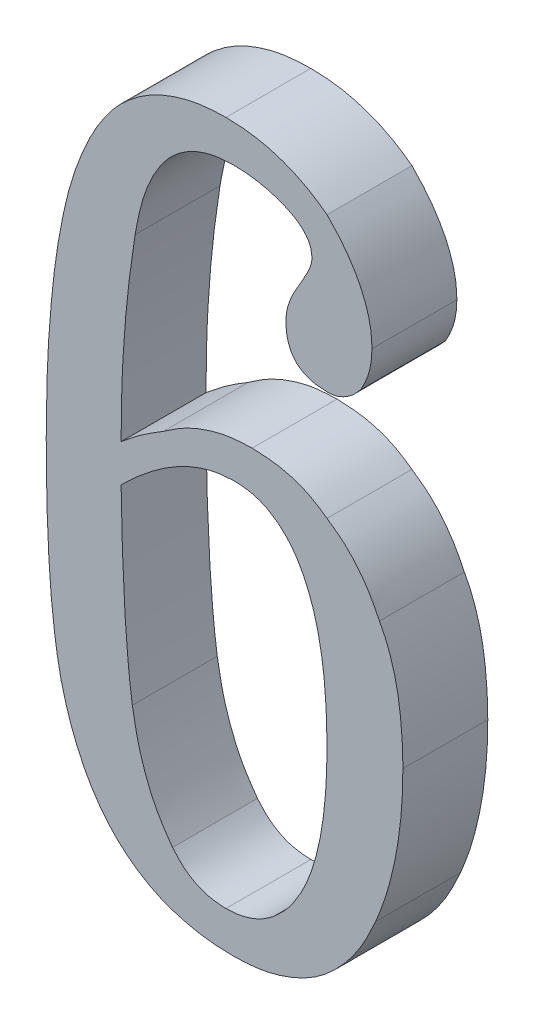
ISO-10303-21;
HEADER;
FILE_DESCRIPTION(('STEP AP214'),'2;1');
FILE_NAME('part.step','',(''),(''),'','','');
FILE_SCHEMA(('AUTOMOTIVE_DESIGN { 1 0 10303 214 1 1 1 1 }'));
ENDSEC;
DATA;
#1=APPLICATION_CONTEXT('core data for automotive mechanical design processes');
#2=APPLICATION_PROTOCOL_DEFINITION('international standard','automotive_design',2000,#1);
#3=PRODUCT_CONTEXT('',#1,'mechanical');
#4=PRODUCT('Part','Part','',(#3));
#5=PRODUCT_RELATED_PRODUCT_CATEGORY('part','',(#4));
#6=PRODUCT_DEFINITION_FORMATION('','',#4);
#7=PRODUCT_DEFINITION_CONTEXT('part definition',#1,'design');
#8=PRODUCT_DEFINITION('design','',#6,#7);
#9=PRODUCT_DEFINITION_SHAPE('','',#8);
#10=(LENGTH_UNIT() NAMED_UNIT(*) SI_UNIT(.MILLI.,.METRE.));
#11=(NAMED_UNIT(*) PLANE_ANGLE_UNIT() SI_UNIT($,.RADIAN.));
#12=(NAMED_UNIT(*) SI_UNIT($,.STERADIAN.) SOLID_ANGLE_UNIT());
#13=UNCERTAINTY_MEASURE_WITH_UNIT(LENGTH_MEASURE(1.E-05),#10,'distance_accuracy_value','');
#14=(GEOMETRIC_REPRESENTATION_CONTEXT(3) GLOBAL_UNCERTAINTY_ASSIGNED_CONTEXT((#13)) GLOBAL_UNIT_ASSIGNED_CONTEXT((#10,
#11,#12)) REPRESENTATION_CONTEXT('',''));
#15=CARTESIAN_POINT('',(0.,0.,0.));
#16=DIRECTION('',(0.,0.,1.));
#17=DIRECTION('',(1.,0.,0.));
#18=AXIS2_PLACEMENT_3D('',#15,#16,#17);
#19=CARTESIAN_POINT('',(9.71905087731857,22.5473632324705,3.));
#20=DIRECTION('',(0.,0.,-1.));
#21=DIRECTION('',(-1.,0.,0.));
#22=AXIS2_PLACEMENT_3D('',#19,#20,#21);
#23=PLANE('',#22);
#24=CARTESIAN_POINT('',(10.5477170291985,22.3202038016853,3.));
#25=CARTESIAN_POINT('',(10.4146448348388,22.3671262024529,3.));
#26=CARTESIAN_POINT('',(10.1473183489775,22.4613878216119,3.));
#27=CARTESIAN_POINT('',(9.72958200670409,22.5517126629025,3.));
#28=CARTESIAN_POINT('',(9.29995604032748,22.6070518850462,3.));
#29=CARTESIAN_POINT('',(9.00957918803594,22.615013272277,3.));
#30=CARTESIAN_POINT('',(8.86243386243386,22.6190476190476,3.));
#31=B_SPLINE_CURVE_WITH_KNOTS('',3,(#24,#25,#26,#27,#28,#29,#30),.UNSPECIFIED.,.F.,.F.,(4,1,1,1,
4),(0.,0.245809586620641,0.493802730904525,0.743490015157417,1.),.UNSPECIFIED.);
#32=CARTESIAN_POINT('',(10.5477170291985,22.3202038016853,3.));
#33=VERTEX_POINT('',#32);
#34=CARTESIAN_POINT('',(8.86243386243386,22.6190476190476,3.));
#35=VERTEX_POINT('',#34);
#36=EDGE_CURVE('E528',#33,#35,#31,.T.);
#37=ORIENTED_EDGE('',*,*,#36,.F.);
#38=CARTESIAN_POINT('',(11.6402116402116,21.1640211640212,3.));
#39=CARTESIAN_POINT('',(11.6269620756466,21.2833021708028,3.));
#40=CARTESIAN_POINT('',(11.5998497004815,21.5273850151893,3.));
#41=CARTESIAN_POINT('',(11.3638737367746,21.8500293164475,3.));
#42=CARTESIAN_POINT('',(11.0096518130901,22.1252959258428,3.));
#43=CARTESIAN_POINT('',(10.7119983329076,22.2508872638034,3.));
#44=CARTESIAN_POINT('',(10.5477170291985,22.3202038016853,3.));
#45=B_SPLINE_CURVE_WITH_KNOTS('',3,(#38,#39,#40,#41,#42,#43,#44),.UNSPECIFIED.,.F.,.F.,(4,1,1,1,
4),(0.,0.209753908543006,0.429216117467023,0.684972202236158,1.),.UNSPECIFIED.);
#46=CARTESIAN_POINT('',(11.6402116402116,21.1640211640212,3.));
#47=VERTEX_POINT('',#46);
#48=EDGE_CURVE('E311',#47,#33,#45,.T.);
#49=ORIENTED_EDGE('',*,*,#48,.F.);
#50=CARTESIAN_POINT('',(11.2433862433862,20.2038016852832,3.));
#51=CARTESIAN_POINT('',(11.3017114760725,20.3061001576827,3.));
#52=CARTESIAN_POINT('',(11.4085402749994,20.4934705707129,3.));
#53=CARTESIAN_POINT('',(11.5370775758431,20.7547487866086,3.));
#54=CARTESIAN_POINT('',(11.6201435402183,20.9730424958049,3.));
#55=CARTESIAN_POINT('',(11.6341576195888,21.1064078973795,3.));
#56=CARTESIAN_POINT('',(11.6402116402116,21.1640211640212,3.));
#57=B_SPLINE_CURVE_WITH_KNOTS('',3,(#50,#51,#52,#53,#54,#55,#56),.UNSPECIFIED.,.F.,.F.,(4,1,1,1,
4),(0.,0.337017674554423,0.617283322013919,0.83466807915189,1.),.UNSPECIFIED.);
#58=CARTESIAN_POINT('',(11.2433862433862,20.2038016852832,3.));
#59=VERTEX_POINT('',#58);
#60=EDGE_CURVE('E318',#59,#47,#57,.T.);
#61=ORIENTED_EDGE('',*,*,#60,.F.);
#62=CARTESIAN_POINT('',(10.7142857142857,18.7830687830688,3.));
#63=CARTESIAN_POINT('',(10.7221061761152,18.8881780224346,3.));
#64=CARTESIAN_POINT('',(10.7387698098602,19.1121420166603,3.));
#65=CARTESIAN_POINT('',(10.8441377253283,19.4575639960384,3.));
#66=CARTESIAN_POINT('',(11.0145691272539,19.8271957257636,3.));
#67=CARTESIAN_POINT('',(11.1639170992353,20.0730048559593,3.));
#68=CARTESIAN_POINT('',(11.2433862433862,20.2038016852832,3.));
#69=B_SPLINE_CURVE_WITH_KNOTS('',3,(#62,#63,#64,#65,#66,#67,#68),.UNSPECIFIED.,.F.,.F.,(4,1,1,1,
4),(0.,0.205575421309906,0.438034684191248,0.700974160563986,1.),.UNSPECIFIED.);
#70=CARTESIAN_POINT('',(10.7142857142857,18.7830687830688,3.));
#71=VERTEX_POINT('',#70);
#72=EDGE_CURVE('E845',#71,#59,#69,.T.);
#73=ORIENTED_EDGE('',*,*,#72,.F.);
#74=CARTESIAN_POINT('',(12.1693121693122,17.3280423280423,3.));
#75=CARTESIAN_POINT('',(12.0546065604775,17.3324164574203,3.));
#76=CARTESIAN_POINT('',(11.8391974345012,17.3406307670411,3.));
#77=CARTESIAN_POINT('',(11.5382791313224,17.4094668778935,3.));
#78=CARTESIAN_POINT('',(11.2822733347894,17.5224779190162,3.));
#79=CARTESIAN_POINT('',(11.0677477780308,17.6815043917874,3.));
#80=CARTESIAN_POINT('',(10.9087213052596,17.896029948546,3.));
#81=CARTESIAN_POINT('',(10.7957102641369,18.152035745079,3.));
#82=CARTESIAN_POINT('',(10.7268741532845,18.4529540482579,3.));
#83=CARTESIAN_POINT('',(10.7186598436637,18.6683631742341,3.));
#84=CARTESIAN_POINT('',(10.7142857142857,18.7830687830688,3.));
#85=B_SPLINE_CURVE_WITH_KNOTS('',3,(#74,#75,#76,#77,#78,#79,#80,#81,#82,#83,#84),.UNSPECIFIED.,
.F.,.F.,(4,1,1,1,1,1,1,1,4),(0.,0.145877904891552,0.273948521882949,0.390242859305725,
0.499999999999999,0.609757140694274,0.726051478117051,0.854122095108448,1.),.UNSPECIFIED.);
#86=CARTESIAN_POINT('',(12.1693121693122,17.3280423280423,3.));
#87=VERTEX_POINT('',#86);
#88=EDGE_CURVE('E839',#87,#71,#85,.T.);
#89=ORIENTED_EDGE('',*,*,#88,.F.);
#90=CARTESIAN_POINT('',(13.3597883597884,17.989417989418,3.));
#91=CARTESIAN_POINT('',(13.2721515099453,17.8889156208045,3.));
#92=CARTESIAN_POINT('',(13.106490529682,17.6989347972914,3.));
#93=CARTESIAN_POINT('',(12.8096579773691,17.4898866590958,3.));
#94=CARTESIAN_POINT('',(12.4982591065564,17.3477796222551,3.));
#95=CARTESIAN_POINT('',(12.2785515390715,17.3345968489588,3.));
#96=CARTESIAN_POINT('',(12.1693121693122,17.3280423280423,3.));
#97=B_SPLINE_CURVE_WITH_KNOTS('',3,(#90,#91,#92,#93,#94,#95,#96),.UNSPECIFIED.,.F.,.F.,(4,1,1,1,
4),(0.,0.282957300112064,0.534877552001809,0.768739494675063,1.),.UNSPECIFIED.);
#98=CARTESIAN_POINT('',(13.3597883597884,17.989417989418,3.));
#99=VERTEX_POINT('',#98);
#100=EDGE_CURVE('E819',#99,#87,#97,.T.);
#101=ORIENTED_EDGE('',*,*,#100,.F.);
#102=CARTESIAN_POINT('',(13.7566137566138,19.4444444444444,3.));
#103=CARTESIAN_POINT('',(13.7519609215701,19.315090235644,3.));
#104=CARTESIAN_POINT('',(13.7427547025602,19.0591466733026,3.));
#105=CARTESIAN_POINT('',(13.6673323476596,18.6826305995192,3.));
#106=CARTESIAN_POINT('',(13.5402426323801,18.3234799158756,3.));
#107=CARTESIAN_POINT('',(13.4199080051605,18.1007131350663,3.));
#108=CARTESIAN_POINT('',(13.3597883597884,17.989417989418,3.));
#109=B_SPLINE_CURVE_WITH_KNOTS('',3,(#102,#103,#104,#105,#106,#107,#108),.UNSPECIFIED.,.F.,.F.,
(4,1,1,1,4),(0.,0.254130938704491,0.502830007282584,0.751611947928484,1.),.UNSPECIFIED.);
#110=CARTESIAN_POINT('',(13.7566137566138,19.4444444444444,3.));
#111=VERTEX_POINT('',#110);
#112=EDGE_CURVE('E809',#111,#99,#109,.T.);
#113=ORIENTED_EDGE('',*,*,#112,.F.);
#114=CARTESIAN_POINT('',(12.1693121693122,22.7513227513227,3.));
#115=CARTESIAN_POINT('',(12.2957232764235,22.6211290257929,3.));
#116=CARTESIAN_POINT('',(12.542821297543,22.3666370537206,3.));
#117=CARTESIAN_POINT('',(12.8647652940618,21.9606343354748,3.));
#118=CARTESIAN_POINT('',(13.1360791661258,21.5496635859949,3.));
#119=CARTESIAN_POINT('',(13.3659979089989,21.1396427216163,3.));
#120=CARTESIAN_POINT('',(13.5347960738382,20.719824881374,3.));
#121=CARTESIAN_POINT('',(13.6679717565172,20.3003720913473,3.));
#122=CARTESIAN_POINT('',(13.7416547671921,19.8732775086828,3.));
#123=CARTESIAN_POINT('',(13.7516490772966,19.586768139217,3.));
#124=CARTESIAN_POINT('',(13.7566137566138,19.4444444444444,3.));
#125=B_SPLINE_CURVE_WITH_KNOTS('',3,(#114,#115,#116,#117,#118,#119,#120,#121,#122,#123,#124),
.UNSPECIFIED.,.F.,.F.,(4,1,1,1,1,1,1,1,4),(0.,0.144494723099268,0.282446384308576,
0.411976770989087,0.536565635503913,0.656150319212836,0.771785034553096,0.88663408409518,1.),.UNSPECIFIED.);
#126=CARTESIAN_POINT('',(12.1693121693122,22.7513227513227,3.));
#127=VERTEX_POINT('',#126);
#128=EDGE_CURVE('E799',#127,#111,#125,.T.);
#129=ORIENTED_EDGE('',*,*,#128,.F.);
#130=CARTESIAN_POINT('',(8.5978835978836,23.9417989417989,3.));
#131=CARTESIAN_POINT('',(8.7646005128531,23.9377835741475,3.));
#132=CARTESIAN_POINT('',(9.09237850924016,23.929889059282,3.));
#133=CARTESIAN_POINT('',(9.57743022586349,23.8747288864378,3.));
#134=CARTESIAN_POINT('',(10.0467732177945,23.7836383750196,3.));
#135=CARTESIAN_POINT('',(10.5008480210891,23.6476008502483,3.));
#136=CARTESIAN_POINT('',(10.9432569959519,23.4831992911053,3.));
#137=CARTESIAN_POINT('',(11.3683556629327,23.2760967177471,3.));
#138=CARTESIAN_POINT('',(11.7805955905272,23.0348834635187,3.));
#139=CARTESIAN_POINT('',(12.0385691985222,22.8466970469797,3.));
#140=CARTESIAN_POINT('',(12.1693121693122,22.7513227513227,3.));
#141=B_SPLINE_CURVE_WITH_KNOTS('',3,(#130,#131,#132,#133,#134,#135,#136,#137,#138,#139,#140),
.UNSPECIFIED.,.F.,.F.,(4,1,1,1,1,1,1,1,4),(0.,0.130421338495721,0.256418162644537,
0.381452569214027,0.503954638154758,0.626875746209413,0.750307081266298,0.873453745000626,1.),.UNSPECIFIED.);
#142=CARTESIAN_POINT('',(8.5978835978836,23.9417989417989,3.));
#143=VERTEX_POINT('',#142);
#144=EDGE_CURVE('E793',#143,#127,#141,.T.);
#145=ORIENTED_EDGE('',*,*,#144,.F.);
#146=CARTESIAN_POINT('',(5.15873015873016,22.7513227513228,3.));
#147=CARTESIAN_POINT('',(5.2760837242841,22.8469400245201,3.));
#148=CARTESIAN_POINT('',(5.50908199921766,23.0367822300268,3.));
#149=CARTESIAN_POINT('',(5.89178629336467,23.2767443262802,3.));
#150=CARTESIAN_POINT('',(6.29251879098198,23.4839661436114,3.));
#151=CARTESIAN_POINT('',(6.71570638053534,23.6482994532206,3.));
#152=CARTESIAN_POINT('',(7.15523828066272,23.7841578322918,3.));
#153=CARTESIAN_POINT('',(7.61813516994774,23.8760174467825,3.));
#154=CARTESIAN_POINT('',(8.10180811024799,23.9294937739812,3.));
#155=CARTESIAN_POINT('',(8.43118098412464,23.9376638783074,3.));
#156=CARTESIAN_POINT('',(8.5978835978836,23.9417989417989,3.));
#157=B_SPLINE_CURVE_WITH_KNOTS('',3,(#146,#147,#148,#149,#150,#151,#152,#153,#154,#155,#156),
.UNSPECIFIED.,.F.,.F.,(4,1,1,1,1,1,1,1,4),(0.,0.122011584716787,0.242246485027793,
0.363616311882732,0.485442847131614,0.607965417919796,0.734302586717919,0.865524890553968,1.),.UNSPECIFIED.);
#158=CARTESIAN_POINT('',(5.15873015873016,22.7513227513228,3.));
#159=VERTEX_POINT('',#158);
#160=EDGE_CURVE('E770',#159,#143,#157,.T.);
#161=ORIENTED_EDGE('',*,*,#160,.F.);
#162=CARTESIAN_POINT('',(3.04232804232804,18.9153439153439,3.));
#163=CARTESIAN_POINT('',(3.10337852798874,19.1284781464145,3.));
#164=CARTESIAN_POINT('',(3.22234327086,19.543797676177,3.));
#165=CARTESIAN_POINT('',(3.44000721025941,20.1364771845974,3.));
#166=CARTESIAN_POINT('',(3.67419061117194,20.686612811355,3.));
#167=CARTESIAN_POINT('',(3.92736820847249,21.1918686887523,3.));
#168=CARTESIAN_POINT('',(4.20265705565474,21.6505189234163,3.));
#169=CARTESIAN_POINT('',(4.49765244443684,22.0629731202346,3.));
#170=CARTESIAN_POINT('',(4.8082008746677,22.4364754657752,3.));
#171=CARTESIAN_POINT('',(5.04342800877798,22.6477577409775,3.));
#172=CARTESIAN_POINT('',(5.15873015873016,22.7513227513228,3.));
#173=B_SPLINE_CURVE_WITH_KNOTS('',3,(#162,#163,#164,#165,#166,#167,#168,#169,#170,#171,#172),
.UNSPECIFIED.,.F.,.F.,(4,1,1,1,1,1,1,1,4),(0.,0.149659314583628,0.291630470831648,
0.425993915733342,0.553222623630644,0.672927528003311,0.786754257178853,0.895472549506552,1.),.UNSPECIFIED.);
#174=CARTESIAN_POINT('',(3.04232804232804,18.9153439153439,3.));
#175=VERTEX_POINT('',#174);
#176=EDGE_CURVE('E760',#175,#159,#173,.T.);
#177=ORIENTED_EDGE('',*,*,#176,.F.);
#178=CARTESIAN_POINT('',(2.24867724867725,10.978835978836,3.));
#179=CARTESIAN_POINT('',(2.25233685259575,11.3789417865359,3.));
#180=CARTESIAN_POINT('',(2.25949305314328,12.1613317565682,3.));
#181=CARTESIAN_POINT('',(2.29069964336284,13.3033596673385,3.));
#182=CARTESIAN_POINT('',(2.35534812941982,14.3863817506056,3.));
#183=CARTESIAN_POINT('',(2.44405351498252,15.4071262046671,3.));
#184=CARTESIAN_POINT('',(2.54845432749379,16.371897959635,3.));
#185=CARTESIAN_POINT('',(2.68569576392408,17.2737585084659,3.));
#186=CARTESIAN_POINT('',(2.84534244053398,18.1176699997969,3.));
#187=CARTESIAN_POINT('',(2.97793286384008,18.6545819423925,3.));
#188=CARTESIAN_POINT('',(3.04232804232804,18.9153439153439,3.));
#189=B_SPLINE_CURVE_WITH_KNOTS('',3,(#178,#179,#180,#181,#182,#183,#184,#185,#186,#187,#188),
.UNSPECIFIED.,.F.,.F.,(4,1,1,1,1,1,1,1,4),(0.,0.150113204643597,0.293540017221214,
0.428560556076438,0.557080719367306,0.67791636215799,0.79254948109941,0.899247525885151,1.),.UNSPECIFIED.);
#190=CARTESIAN_POINT('',(2.24867724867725,10.978835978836,3.));
#191=VERTEX_POINT('',#190);
#192=EDGE_CURVE('E750',#191,#175,#189,.T.);
#193=ORIENTED_EDGE('',*,*,#192,.F.);
#194=CARTESIAN_POINT('',(2.77777777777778,3.80168528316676,3.));
#195=CARTESIAN_POINT('',(2.73505140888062,4.00710121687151,3.));
#196=CARTESIAN_POINT('',(2.6442016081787,4.44388059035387,3.));
#197=CARTESIAN_POINT('',(2.5409847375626,5.14415885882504,3.));
#198=CARTESIAN_POINT('',(2.44650783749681,5.92313576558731,3.));
#199=CARTESIAN_POINT('',(2.37653992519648,6.78129111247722,3.));
#200=CARTESIAN_POINT('',(2.31620543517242,7.71704789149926,3.));
#201=CARTESIAN_POINT('',(2.27991467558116,8.73319893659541,3.));
#202=CARTESIAN_POINT('',(2.25475712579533,9.82905905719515,3.));
#203=CARTESIAN_POINT('',(2.25074979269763,10.5868933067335,3.));
#204=CARTESIAN_POINT('',(2.24867724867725,10.978835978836,3.));
#205=B_SPLINE_CURVE_WITH_KNOTS('',3,(#194,#195,#196,#197,#198,#199,#200,#201,#202,#203,#204),
.UNSPECIFIED.,.F.,.F.,(4,1,1,1,1,1,1,1,4),(0.,0.0872957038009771,0.185618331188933,
0.294439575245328,0.413801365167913,0.543856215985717,0.68463336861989,0.836896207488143,1.),.UNSPECIFIED.);
#206=CARTESIAN_POINT('',(2.77777777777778,3.80168528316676,3.));
#207=VERTEX_POINT('',#206);
#208=EDGE_CURVE('E744',#207,#191,#205,.T.);
#209=ORIENTED_EDGE('',*,*,#208,.F.);
#210=CARTESIAN_POINT('',(8.86243386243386,-1.58730158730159,3.));
#211=CARTESIAN_POINT('',(8.66629798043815,-1.58404956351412,3.));
#212=CARTESIAN_POINT('',(8.28272951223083,-1.57768982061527,3.));
#213=CARTESIAN_POINT('',(7.72202550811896,-1.51304572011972,3.));
#214=CARTESIAN_POINT('',(7.18988358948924,-1.40435055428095,3.));
#215=CARTESIAN_POINT('',(6.68485689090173,-1.25792096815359,3.));
#216=CARTESIAN_POINT('',(6.20360823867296,-1.07247370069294,3.));
#217=CARTESIAN_POINT('',(5.7541539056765,-0.835416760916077,3.));
#218=CARTESIAN_POINT('',(5.33039736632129,-0.560610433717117,3.));
#219=CARTESIAN_POINT('',(4.93521299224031,-0.243646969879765,3.));
#220=CARTESIAN_POINT('',(4.5660854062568,0.114275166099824,3.));
#221=CARTESIAN_POINT('',(4.22939622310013,0.519665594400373,3.));
#222=CARTESIAN_POINT('',(3.91299154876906,0.961326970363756,3.));
#223=CARTESIAN_POINT('',(3.63029996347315,1.44796740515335,3.));
#224=CARTESIAN_POINT('',(3.37528484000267,1.97606325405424,3.));
#225=CARTESIAN_POINT('',(3.14446478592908,2.54497648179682,3.));
#226=CARTESIAN_POINT('',(2.94484406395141,3.15807846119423,3.));
#227=CARTESIAN_POINT('',(2.83431923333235,3.58386475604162,3.));
#228=CARTESIAN_POINT('',(2.77777777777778,3.80168528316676,3.));
#229=B_SPLINE_CURVE_WITH_KNOTS('',3,(#210,#211,#212,#213,#214,#215,#216,#217,#218,#219,#220,
#221,#222,#223,#224,#225,#226,#227,#228),.UNSPECIFIED.,.F.,.F.,(4,1,1,1,1,1,1,1,1,1,1,1,1,1,1,1,
4),(0.,0.0661234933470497,0.129312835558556,0.190012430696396,0.249094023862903,
0.306467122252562,0.36361510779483,0.420133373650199,0.476554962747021,0.534194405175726,
0.593214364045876,0.65403376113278,0.717223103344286,0.782740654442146,0.851669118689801,
0.924118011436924,1.),.UNSPECIFIED.);
#230=CARTESIAN_POINT('',(8.86243386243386,-1.58730158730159,3.));
#231=VERTEX_POINT('',#230);
#232=EDGE_CURVE('E721',#231,#207,#229,.T.);
#233=ORIENTED_EDGE('',*,*,#232,.F.);
#234=CARTESIAN_POINT('',(13.8888888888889,1.98412698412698,3.));
#235=CARTESIAN_POINT('',(13.7583809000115,1.70144365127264,3.));
#236=CARTESIAN_POINT('',(13.5070299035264,1.1570115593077,3.));
#237=CARTESIAN_POINT('',(13.0337752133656,0.421103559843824,3.));
#238=CARTESIAN_POINT('',(12.4893833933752,-0.194463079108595,3.));
#239=CARTESIAN_POINT('',(11.893295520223,-0.713521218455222,3.));
#240=CARTESIAN_POINT('',(11.220424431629,-1.10178755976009,3.));
#241=CARTESIAN_POINT('',(10.4902561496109,-1.38323057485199,3.));
#242=CARTESIAN_POINT('',(9.69723767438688,-1.5615060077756,3.));
#243=CARTESIAN_POINT('',(9.14591628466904,-1.57854193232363,3.));
#244=CARTESIAN_POINT('',(8.86243386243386,-1.58730158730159,3.));
#245=B_SPLINE_CURVE_WITH_KNOTS('',3,(#234,#235,#236,#237,#238,#239,#240,#241,#242,#243,#244),
.UNSPECIFIED.,.F.,.F.,(4,1,1,1,1,1,1,1,4),(0.,0.14180171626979,0.273102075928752,
0.397033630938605,0.515304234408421,0.631724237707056,0.749073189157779,0.870976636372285,1.),.UNSPECIFIED.);
#246=CARTESIAN_POINT('',(13.8888888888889,1.98412698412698,3.));
#247=VERTEX_POINT('',#246);
#248=EDGE_CURVE('E711',#247,#231,#245,.T.);
#249=ORIENTED_EDGE('',*,*,#248,.F.);
#250=CARTESIAN_POINT('',(14.8491083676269,7.14285714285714,3.));
#251=CARTESIAN_POINT('',(14.8461535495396,6.9043875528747,3.));
#252=CARTESIAN_POINT('',(14.8402995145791,6.43193568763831,3.));
#253=CARTESIAN_POINT('',(14.7977468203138,5.73345121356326,3.));
#254=CARTESIAN_POINT('',(14.7162469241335,5.05743615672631,3.));
#255=CARTESIAN_POINT('',(14.6167261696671,4.40072004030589,3.));
#256=CARTESIAN_POINT('',(14.4770010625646,3.76745784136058,3.));
#257=CARTESIAN_POINT('',(14.3177367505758,3.15110338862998,3.));
#258=CARTESIAN_POINT('',(14.121648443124,2.5575055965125,3.));
#259=CARTESIAN_POINT('',(13.9661227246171,2.17438439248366,3.));
#260=CARTESIAN_POINT('',(13.8888888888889,1.98412698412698,3.));
#261=B_SPLINE_CURVE_WITH_KNOTS('',3,(#250,#251,#252,#253,#254,#255,#256,#257,#258,#259,#260),
.UNSPECIFIED.,.F.,.F.,(4,1,1,1,1,1,1,1,4),(0.,0.135425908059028,0.268303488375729,
0.397139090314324,0.52200852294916,0.645332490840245,0.765226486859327,0.883411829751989,1.),.UNSPECIFIED.);
#262=CARTESIAN_POINT('',(14.8491083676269,7.14285714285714,3.));
#263=VERTEX_POINT('',#262);
#264=EDGE_CURVE('E701',#263,#247,#261,.T.);
#265=ORIENTED_EDGE('',*,*,#264,.F.);
#266=CARTESIAN_POINT('',(14.021164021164,11.2433862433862,3.));
#267=CARTESIAN_POINT('',(14.0892447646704,11.1173064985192,3.));
#268=CARTESIAN_POINT('',(14.2291486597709,10.8582163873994,3.));
#269=CARTESIAN_POINT('',(14.3908432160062,10.4337074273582,3.));
#270=CARTESIAN_POINT('',(14.5341034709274,9.9758494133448,3.));
#271=CARTESIAN_POINT('',(14.6513045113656,9.48160907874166,3.));
#272=CARTESIAN_POINT('',(14.7377987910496,8.94931374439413,3.));
#273=CARTESIAN_POINT('',(14.8007386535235,8.38027389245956,3.));
#274=CARTESIAN_POINT('',(14.8401255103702,7.77375198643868,3.));
#275=CARTESIAN_POINT('',(14.8460615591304,7.35684426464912,3.));
#276=CARTESIAN_POINT('',(14.8491083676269,7.14285714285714,3.));
#277=B_SPLINE_CURVE_WITH_KNOTS('',3,(#266,#267,#268,#269,#270,#271,#272,#273,#274,#275,#276),
.UNSPECIFIED.,.F.,.F.,(4,1,1,1,1,1,1,1,4),(0.,0.101589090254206,0.208762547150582,
0.321660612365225,0.441970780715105,0.568860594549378,0.70413687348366,0.848141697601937,1.),.UNSPECIFIED.);
#278=CARTESIAN_POINT('',(14.021164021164,11.2433862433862,3.));
#279=VERTEX_POINT('',#278);
#280=EDGE_CURVE('E695',#279,#263,#277,.T.);
#281=ORIENTED_EDGE('',*,*,#280,.F.);
#282=CARTESIAN_POINT('',(12.1693121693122,13.4577699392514,3.));
#283=CARTESIAN_POINT('',(12.3622582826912,13.3234903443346,3.));
#284=CARTESIAN_POINT('',(12.749994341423,13.0536479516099,3.));
#285=CARTESIAN_POINT('',(13.2449678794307,12.5296008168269,3.));
#286=CARTESIAN_POINT('',(13.6844738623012,11.9294839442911,3.));
#287=CARTESIAN_POINT('',(13.9070292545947,11.4759668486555,3.));
#288=CARTESIAN_POINT('',(14.021164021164,11.2433862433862,3.));
#289=B_SPLINE_CURVE_WITH_KNOTS('',3,(#282,#283,#284,#285,#286,#287,#288),.UNSPECIFIED.,.F.,.F.,
(4,1,1,1,4),(0.,0.240394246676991,0.483085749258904,0.734906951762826,1.),.UNSPECIFIED.);
#290=CARTESIAN_POINT('',(12.1693121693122,13.4577699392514,3.));
#291=VERTEX_POINT('',#290);
#292=EDGE_CURVE('E672',#291,#279,#289,.T.);
#293=ORIENTED_EDGE('',*,*,#292,.F.);
#294=CARTESIAN_POINT('',(9.52380952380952,14.2857142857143,3.));
#295=CARTESIAN_POINT('',(9.77775151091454,14.2752753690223,3.));
#296=CARTESIAN_POINT('',(10.2692190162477,14.2550723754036,3.));
#297=CARTESIAN_POINT('',(10.9735835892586,14.1020633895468,3.));
#298=CARTESIAN_POINT('',(11.6160669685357,13.8439649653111,3.));
#299=CARTESIAN_POINT('',(11.9856969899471,13.5859432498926,3.));
#300=CARTESIAN_POINT('',(12.1693121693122,13.4577699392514,3.));
#301=B_SPLINE_CURVE_WITH_KNOTS('',3,(#294,#295,#296,#297,#298,#299,#300),.UNSPECIFIED.,.F.,.F.,
(4,1,1,1,4),(0.,0.26976246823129,0.522085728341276,0.76259418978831,1.),.UNSPECIFIED.);
#302=CARTESIAN_POINT('',(9.52380952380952,14.2857142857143,3.));
#303=VERTEX_POINT('',#302);
#304=EDGE_CURVE('E662',#303,#291,#301,.T.);
#305=ORIENTED_EDGE('',*,*,#304,.F.);
#306=CARTESIAN_POINT('',(6.38349990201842,13.2275132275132,3.));
#307=CARTESIAN_POINT('',(6.62180287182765,13.3915803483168,3.));
#308=CARTESIAN_POINT('',(7.08906390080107,13.7132807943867,3.));
#309=CARTESIAN_POINT('',(7.87041080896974,14.0386905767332,3.));
#310=CARTESIAN_POINT('',(8.68262174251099,14.2533205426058,3.));
#311=CARTESIAN_POINT('',(9.24153534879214,14.2748440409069,3.));
#312=CARTESIAN_POINT('',(9.52380952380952,14.2857142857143,3.));
#313=B_SPLINE_CURVE_WITH_KNOTS('',3,(#306,#307,#308,#309,#310,#311,#312),.UNSPECIFIED.,.F.,.F.,
(4,1,1,1,4),(0.,0.256834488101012,0.50359736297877,0.749296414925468,1.),.UNSPECIFIED.);
#314=CARTESIAN_POINT('',(6.38349990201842,13.2275132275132,3.));
#315=VERTEX_POINT('',#314);
#316=EDGE_CURVE('E652',#315,#303,#313,.T.);
#317=ORIENTED_EDGE('',*,*,#316,.F.);
#318=CARTESIAN_POINT('',(4.89417989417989,12.1693121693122,3.));
#319=CARTESIAN_POINT('',(5.13016738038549,12.3628345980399,3.));
#320=CARTESIAN_POINT('',(5.60219654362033,12.749923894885,3.));
#321=CARTESIAN_POINT('',(6.12304551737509,13.0683045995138,3.));
#322=CARTESIAN_POINT('',(6.38349990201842,13.2275132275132,3.));
#323=B_SPLINE_CURVE_WITH_KNOTS('',3,(#318,#319,#320,#321,#322),.UNSPECIFIED.,.F.,.F.,(4,1,4),
(0.,0.499942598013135,1.),.UNSPECIFIED.);
#324=CARTESIAN_POINT('',(4.89417989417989,12.1693121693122,3.));
#325=VERTEX_POINT('',#324);
#326=EDGE_CURVE('E646',#325,#315,#323,.T.);
#327=ORIENTED_EDGE('',*,*,#326,.F.);
#328=CARTESIAN_POINT('',(5.38898687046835,18.7487752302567,3.));
#329=CARTESIAN_POINT('',(5.31257309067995,18.2365807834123,3.));
#330=CARTESIAN_POINT('',(5.15649568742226,17.1904084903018,3.));
#331=CARTESIAN_POINT('',(5.0049853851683,15.5782715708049,3.));
#332=CARTESIAN_POINT('',(4.90899312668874,13.8966127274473,3.));
#333=CARTESIAN_POINT('',(4.89918078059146,12.7524417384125,3.));
#334=CARTESIAN_POINT('',(4.89417989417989,12.1693121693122,3.));
#335=B_SPLINE_CURVE_WITH_KNOTS('',3,(#328,#329,#330,#331,#332,#333,#334),.UNSPECIFIED.,.F.,.F.,
(4,1,1,1,4),(0.,0.235179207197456,0.480360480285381,0.735164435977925,1.),.UNSPECIFIED.);
#336=CARTESIAN_POINT('',(5.38898687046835,18.7487752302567,3.));
#337=VERTEX_POINT('',#336);
#338=EDGE_CURVE('E613',#337,#325,#335,.T.);
#339=ORIENTED_EDGE('',*,*,#338,.F.);
#340=CARTESIAN_POINT('',(8.86243386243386,22.6190476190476,3.));
#341=CARTESIAN_POINT('',(8.63412132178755,22.6091058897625,3.));
#342=CARTESIAN_POINT('',(8.19247954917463,22.5898748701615,3.));
#343=CARTESIAN_POINT('',(7.56460616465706,22.4021502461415,3.));
#344=CARTESIAN_POINT('',(7.00952772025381,22.0927814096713,3.));
#345=CARTESIAN_POINT('',(6.52585430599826,21.6589179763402,3.));
#346=CARTESIAN_POINT('',(6.13192956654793,21.0965961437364,3.));
#347=CARTESIAN_POINT('',(5.80002748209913,20.4233975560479,3.));
#348=CARTESIAN_POINT('',(5.54959135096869,19.6278220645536,3.));
#349=CARTESIAN_POINT('',(5.4444474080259,19.0523309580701,3.));
#350=CARTESIAN_POINT('',(5.38898687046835,18.7487752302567,3.));
#351=B_SPLINE_CURVE_WITH_KNOTS('',3,(#340,#341,#342,#343,#344,#345,#346,#347,#348,#349,#350),
.UNSPECIFIED.,.F.,.F.,(4,1,1,1,1,1,1,1,4),(0.,0.118951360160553,0.230096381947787,
0.338496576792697,0.448385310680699,0.566231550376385,0.694727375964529,0.838977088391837,1.),.UNSPECIFIED.);
#352=EDGE_CURVE('E610',#35,#337,#351,.T.);
#353=ORIENTED_EDGE('',*,*,#352,.F.);
#354=EDGE_LOOP('',(#37,#49,#61,#73,#89,#101,#113,#129,#145,#161,#177,#193,#209,#233,#249,#265,
#281,#293,#305,#317,#327,#339,#353));
#355=FACE_BOUND('',#354,.T.);
#356=CARTESIAN_POINT('',(10.4154418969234,12.4681559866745,3.));
#357=CARTESIAN_POINT('',(10.3067698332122,12.5441199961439,3.));
#358=CARTESIAN_POINT('',(10.0886910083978,12.6965615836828,3.));
#359=CARTESIAN_POINT('',(9.71266687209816,12.8531805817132,3.));
#360=CARTESIAN_POINT('',(9.30002957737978,12.9489196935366,3.));
#361=CARTESIAN_POINT('',(9.01159794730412,12.9581760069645,3.));
#362=CARTESIAN_POINT('',(8.86243386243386,12.962962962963,3.));
#363=B_SPLINE_CURVE_WITH_KNOTS('',3,(#356,#357,#358,#359,#360,#361,#362),.UNSPECIFIED.,.F.,.F.,
(4,1,1,1,4),(0.,0.239004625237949,0.47962508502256,0.730885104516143,1.),.UNSPECIFIED.);
#364=CARTESIAN_POINT('',(10.4154418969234,12.4681559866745,3.));
#365=VERTEX_POINT('',#364);
#366=CARTESIAN_POINT('',(8.86243386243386,12.962962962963,3.));
#367=VERTEX_POINT('',#366);
#368=EDGE_CURVE('E245',#365,#367,#363,.T.);
#369=ORIENTED_EDGE('',*,*,#368,.F.);
#370=CARTESIAN_POINT('',(12.1693121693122,6.44718792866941,3.));
#371=CARTESIAN_POINT('',(12.163133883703,6.8179953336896,3.));
#372=CARTESIAN_POINT('',(12.151306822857,7.52783007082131,3.));
#373=CARTESIAN_POINT('',(12.0774645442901,8.5414630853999,3.));
#374=CARTESIAN_POINT('',(11.9409520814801,9.45193332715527,3.));
#375=CARTESIAN_POINT('',(11.7555607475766,10.2610237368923,3.));
#376=CARTESIAN_POINT('',(11.5055291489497,10.9657754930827,3.));
#377=CARTESIAN_POINT('',(11.2091088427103,11.5725980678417,3.));
#378=CARTESIAN_POINT('',(10.8534980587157,12.0818517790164,3.));
#379=CARTESIAN_POINT('',(10.5579313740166,12.3425002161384,3.));
#380=CARTESIAN_POINT('',(10.4154418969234,12.4681559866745,3.));
#381=B_SPLINE_CURVE_WITH_KNOTS('',3,(#370,#371,#372,#373,#374,#375,#376,#377,#378,#379,#380),
.UNSPECIFIED.,.F.,.F.,(4,1,1,1,1,1,1,1,4),(0.,0.172131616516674,0.329510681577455,
0.471342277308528,0.5991250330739,0.714210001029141,0.817604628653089,0.912069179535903,1.),.UNSPECIFIED.);
#382=CARTESIAN_POINT('',(12.1693121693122,6.44718792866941,3.));
#383=VERTEX_POINT('',#382);
#384=EDGE_CURVE('E1137',#383,#365,#381,.T.);
#385=ORIENTED_EDGE('',*,*,#384,.F.);
#386=CARTESIAN_POINT('',(10.2831667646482,0.333137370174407,3.));
#387=CARTESIAN_POINT('',(10.4356172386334,0.473535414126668,3.));
#388=CARTESIAN_POINT('',(10.7485247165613,0.761705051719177,3.));
#389=CARTESIAN_POINT('',(11.1268754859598,1.30611393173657,3.));
#390=CARTESIAN_POINT('',(11.4594477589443,1.93252215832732,3.));
#391=CARTESIAN_POINT('',(11.7176220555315,2.65854186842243,3.));
#392=CARTESIAN_POINT('',(11.9235806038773,3.47370171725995,3.));
#393=CARTESIAN_POINT('',(12.0659149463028,4.38218491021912,3.));
#394=CARTESIAN_POINT('',(12.1543977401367,5.38395826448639,3.));
#395=CARTESIAN_POINT('',(12.1642010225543,6.08282112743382,3.));
#396=CARTESIAN_POINT('',(12.1693121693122,6.44718792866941,3.));
#397=B_SPLINE_CURVE_WITH_KNOTS('',3,(#386,#387,#388,#389,#390,#391,#392,#393,#394,#395,#396),
.UNSPECIFIED.,.F.,.F.,(4,1,1,1,1,1,1,1,4),(0.,0.0940692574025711,0.193078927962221,
0.299794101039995,0.416181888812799,0.542719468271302,0.682006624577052,0.834207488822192,1.),.UNSPECIFIED.);
#398=CARTESIAN_POINT('',(10.2831667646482,0.333137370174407,3.));
#399=VERTEX_POINT('',#398);
#400=EDGE_CURVE('E1143',#399,#383,#397,.T.);
#401=ORIENTED_EDGE('',*,*,#400,.F.);
#402=CARTESIAN_POINT('',(8.5978835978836,-0.264550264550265,3.));
#403=CARTESIAN_POINT('',(8.75379165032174,-0.257078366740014,3.));
#404=CARTESIAN_POINT('',(9.06002734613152,-0.242402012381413,3.));
#405=CARTESIAN_POINT('',(9.5022800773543,-0.124290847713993,3.));
#406=CARTESIAN_POINT('',(9.91770593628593,0.0610680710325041,3.));
#407=CARTESIAN_POINT('',(10.1603867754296,0.241733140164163,3.));
#408=CARTESIAN_POINT('',(10.2831667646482,0.333137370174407,3.));
#409=B_SPLINE_CURVE_WITH_KNOTS('',3,(#402,#403,#404,#405,#406,#407,#408),.UNSPECIFIED.,.F.,.F.,
(4,1,1,1,4),(0.,0.256264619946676,0.503356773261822,0.748732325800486,1.),.UNSPECIFIED.);
#410=CARTESIAN_POINT('',(8.5978835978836,-0.264550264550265,3.));
#411=VERTEX_POINT('',#410);
#412=EDGE_CURVE('E1241',#411,#399,#409,.T.);
#413=ORIENTED_EDGE('',*,*,#412,.F.);
#414=CARTESIAN_POINT('',(6.71173819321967,0.661375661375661,3.));
#415=CARTESIAN_POINT('',(6.83615784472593,0.518969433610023,3.));
#416=CARTESIAN_POINT('',(7.07763073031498,0.242588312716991,3.));
#417=CARTESIAN_POINT('',(7.53838094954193,-0.0512015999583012,3.));
#418=CARTESIAN_POINT('',(8.05060104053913,-0.233341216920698,3.));
#419=CARTESIAN_POINT('',(8.4117749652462,-0.25393733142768,3.));
#420=CARTESIAN_POINT('',(8.5978835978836,-0.264550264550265,3.));
#421=B_SPLINE_CURVE_WITH_KNOTS('',3,(#414,#415,#416,#417,#418,#419,#420),.UNSPECIFIED.,.F.,.F.,
(4,1,1,1,4),(0.,0.259483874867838,0.503604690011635,0.744213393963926,1.),.UNSPECIFIED.);
#422=CARTESIAN_POINT('',(6.71173819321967,0.661375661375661,3.));
#423=VERTEX_POINT('',#422);
#424=EDGE_CURVE('E1245',#423,#411,#421,.T.);
#425=ORIENTED_EDGE('',*,*,#424,.F.);
#426=CARTESIAN_POINT('',(5.29100529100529,4.30139133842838,3.));
#427=CARTESIAN_POINT('',(5.35417683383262,3.94166557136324,3.));
#428=CARTESIAN_POINT('',(5.4755708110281,3.25039637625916,3.));
#429=CARTESIAN_POINT('',(5.79109761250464,2.28152876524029,3.));
#430=CARTESIAN_POINT('',(6.18348773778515,1.40999445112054,3.));
#431=CARTESIAN_POINT('',(6.53877705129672,0.906490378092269,3.));
#432=CARTESIAN_POINT('',(6.71173819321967,0.661375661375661,3.));
#433=B_SPLINE_CURVE_WITH_KNOTS('',3,(#426,#427,#428,#429,#430,#431,#432),.UNSPECIFIED.,.F.,.F.,
(4,1,1,1,4),(0.,0.277196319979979,0.53267598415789,0.772498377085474,1.),.UNSPECIFIED.);
#434=CARTESIAN_POINT('',(5.29100529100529,4.30139133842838,3.));
#435=VERTEX_POINT('',#434);
#436=EDGE_CURVE('E272',#435,#423,#433,.T.);
#437=ORIENTED_EDGE('',*,*,#436,.F.);
#438=CARTESIAN_POINT('',(4.89417989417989,10.8465608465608,3.));
#439=CARTESIAN_POINT('',(4.89993998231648,10.4970778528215,3.));
#440=CARTESIAN_POINT('',(4.9111117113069,9.81925327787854,3.));
#441=CARTESIAN_POINT('',(4.93996092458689,8.83606490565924,3.));
#442=CARTESIAN_POINT('',(4.98063834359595,7.91838641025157,3.));
#443=CARTESIAN_POINT('',(5.02262029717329,7.06732792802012,3.));
#444=CARTESIAN_POINT('',(5.07587263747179,6.2816306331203,3.));
#445=CARTESIAN_POINT('',(5.14082473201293,5.56327535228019,3.));
#446=CARTESIAN_POINT('',(5.20609246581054,4.90933298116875,3.));
#447=CARTESIAN_POINT('',(5.26365535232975,4.49720588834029,3.));
#448=CARTESIAN_POINT('',(5.29100529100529,4.30139133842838,3.));
#449=B_SPLINE_CURVE_WITH_KNOTS('',3,(#438,#439,#440,#441,#442,#443,#444,#445,#446,#447,#448),
.UNSPECIFIED.,.F.,.F.,(4,1,1,1,1,1,1,1,4),(0.,0.159815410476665,0.309963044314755,
0.449718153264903,0.579812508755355,0.699561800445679,0.809750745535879,0.909606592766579,1.),.UNSPECIFIED.);
#450=CARTESIAN_POINT('',(4.89417989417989,10.8465608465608,3.));
#451=VERTEX_POINT('',#450);
#452=EDGE_CURVE('E268',#451,#435,#449,.T.);
#453=ORIENTED_EDGE('',*,*,#452,.F.);
#454=CARTESIAN_POINT('',(8.86243386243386,12.962962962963,3.));
#455=CARTESIAN_POINT('',(8.70683452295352,12.9557010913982,3.));
#456=CARTESIAN_POINT('',(8.38945671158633,12.9408889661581,3.));
#457=CARTESIAN_POINT('',(7.90996520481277,12.8380236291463,3.));
#458=CARTESIAN_POINT('',(7.42435871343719,12.6693928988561,3.));
#459=CARTESIAN_POINT('',(6.92950240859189,12.4344528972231,3.));
#460=CARTESIAN_POINT('',(6.42733519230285,12.1364830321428,3.));
#461=CARTESIAN_POINT('',(5.91947583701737,11.7667888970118,3.));
#462=CARTESIAN_POINT('',(5.40075660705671,11.3380098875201,3.));
#463=CARTESIAN_POINT('',(5.0667014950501,11.0139305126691,3.));
#464=CARTESIAN_POINT('',(4.89417989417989,10.8465608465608,3.));
#465=B_SPLINE_CURVE_WITH_KNOTS('',3,(#454,#455,#456,#457,#458,#459,#460,#461,#462,#463,#464),
.UNSPECIFIED.,.F.,.F.,(4,1,1,1,1,1,1,1,4),(0.,0.101239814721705,0.206500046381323,
0.317749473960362,0.435182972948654,0.562408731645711,0.697200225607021,0.843620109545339,1.),.UNSPECIFIED.);
#466=EDGE_CURVE('E254',#367,#451,#465,.T.);
#467=ORIENTED_EDGE('',*,*,#466,.F.);
#468=EDGE_LOOP('',(#369,#385,#401,#413,#425,#437,#453,#467));
#469=FACE_BOUND('',#468,.T.);
#470=ADVANCED_FACE('F39',(#355,#469),#23,.F.);
#471=CARTESIAN_POINT('',(9.71905087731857,22.5473632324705,0.));
#472=DIRECTION('',(0.,0.,-1.));
#473=DIRECTION('',(-1.,0.,0.));
#474=AXIS2_PLACEMENT_3D('',#471,#472,#473);
#475=PLANE('',#474);
#476=CARTESIAN_POINT('',(10.5477170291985,22.3202038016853,0.));
#477=CARTESIAN_POINT('',(10.4146448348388,22.3671262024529,0.));
#478=CARTESIAN_POINT('',(10.1473183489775,22.4613878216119,0.));
#479=CARTESIAN_POINT('',(9.72958200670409,22.5517126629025,0.));
#480=CARTESIAN_POINT('',(9.29995604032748,22.6070518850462,0.));
#481=CARTESIAN_POINT('',(9.00957918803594,22.615013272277,0.));
#482=CARTESIAN_POINT('',(8.86243386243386,22.6190476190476,0.));
#483=B_SPLINE_CURVE_WITH_KNOTS('',3,(#476,#477,#478,#479,#480,#481,#482),.UNSPECIFIED.,.F.,.F.,
(4,1,1,1,4),(0.,0.245809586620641,0.493802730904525,0.743490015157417,1.),.UNSPECIFIED.);
#484=CARTESIAN_POINT('',(10.5477170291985,22.3202038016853,0.));
#485=VERTEX_POINT('',#484);
#486=CARTESIAN_POINT('',(8.86243386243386,22.6190476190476,0.));
#487=VERTEX_POINT('',#486);
#488=EDGE_CURVE('E263',#485,#487,#483,.T.);
#489=ORIENTED_EDGE('',*,*,#488,.T.);
#490=CARTESIAN_POINT('',(8.86243386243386,22.6190476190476,0.));
#491=CARTESIAN_POINT('',(8.63412132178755,22.6091058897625,0.));
#492=CARTESIAN_POINT('',(8.19247954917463,22.5898748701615,0.));
#493=CARTESIAN_POINT('',(7.56460616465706,22.4021502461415,0.));
#494=CARTESIAN_POINT('',(7.00952772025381,22.0927814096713,0.));
#495=CARTESIAN_POINT('',(6.52585430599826,21.6589179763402,0.));
#496=CARTESIAN_POINT('',(6.13192956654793,21.0965961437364,0.));
#497=CARTESIAN_POINT('',(5.80002748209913,20.4233975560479,0.));
#498=CARTESIAN_POINT('',(5.54959135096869,19.6278220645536,0.));
#499=CARTESIAN_POINT('',(5.4444474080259,19.0523309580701,0.));
#500=CARTESIAN_POINT('',(5.38898687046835,18.7487752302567,0.));
#501=B_SPLINE_CURVE_WITH_KNOTS('',3,(#490,#491,#492,#493,#494,#495,#496,#497,#498,#499,#500),
.UNSPECIFIED.,.F.,.F.,(4,1,1,1,1,1,1,1,4),(0.,0.118951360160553,0.230096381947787,
0.338496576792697,0.448385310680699,0.566231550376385,0.694727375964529,0.838977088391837,1.),.UNSPECIFIED.);
#502=CARTESIAN_POINT('',(5.38898687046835,18.7487752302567,0.));
#503=VERTEX_POINT('',#502);
#504=EDGE_CURVE('E331',#487,#503,#501,.T.);
#505=ORIENTED_EDGE('',*,*,#504,.T.);
#506=CARTESIAN_POINT('',(5.38898687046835,18.7487752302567,0.));
#507=CARTESIAN_POINT('',(5.31257309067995,18.2365807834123,0.));
#508=CARTESIAN_POINT('',(5.15649568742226,17.1904084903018,0.));
#509=CARTESIAN_POINT('',(5.0049853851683,15.5782715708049,0.));
#510=CARTESIAN_POINT('',(4.90899312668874,13.8966127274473,0.));
#511=CARTESIAN_POINT('',(4.89918078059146,12.7524417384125,0.));
#512=CARTESIAN_POINT('',(4.89417989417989,12.1693121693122,0.));
#513=B_SPLINE_CURVE_WITH_KNOTS('',3,(#506,#507,#508,#509,#510,#511,#512),.UNSPECIFIED.,.F.,.F.,
(4,1,1,1,4),(0.,0.235179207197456,0.480360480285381,0.735164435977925,1.),.UNSPECIFIED.);
#514=CARTESIAN_POINT('',(4.89417989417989,12.1693121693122,0.));
#515=VERTEX_POINT('',#514);
#516=EDGE_CURVE('E340',#503,#515,#513,.T.);
#517=ORIENTED_EDGE('',*,*,#516,.T.);
#518=CARTESIAN_POINT('',(4.89417989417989,12.1693121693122,0.));
#519=CARTESIAN_POINT('',(5.13016738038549,12.3628345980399,0.));
#520=CARTESIAN_POINT('',(5.60219654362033,12.749923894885,0.));
#521=CARTESIAN_POINT('',(6.12304551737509,13.0683045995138,0.));
#522=CARTESIAN_POINT('',(6.38349990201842,13.2275132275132,0.));
#523=B_SPLINE_CURVE_WITH_KNOTS('',3,(#518,#519,#520,#521,#522),.UNSPECIFIED.,.F.,.F.,(4,1,4),
(0.,0.499942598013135,1.),.UNSPECIFIED.);
#524=CARTESIAN_POINT('',(6.38349990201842,13.2275132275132,0.));
#525=VERTEX_POINT('',#524);
#526=EDGE_CURVE('E349',#515,#525,#523,.T.);
#527=ORIENTED_EDGE('',*,*,#526,.T.);
#528=CARTESIAN_POINT('',(6.38349990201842,13.2275132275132,0.));
#529=CARTESIAN_POINT('',(6.62180287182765,13.3915803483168,0.));
#530=CARTESIAN_POINT('',(7.08906390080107,13.7132807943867,0.));
#531=CARTESIAN_POINT('',(7.87041080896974,14.0386905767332,0.));
#532=CARTESIAN_POINT('',(8.68262174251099,14.2533205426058,0.));
#533=CARTESIAN_POINT('',(9.24153534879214,14.2748440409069,0.));
#534=CARTESIAN_POINT('',(9.52380952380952,14.2857142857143,0.));
#535=B_SPLINE_CURVE_WITH_KNOTS('',3,(#528,#529,#530,#531,#532,#533,#534),.UNSPECIFIED.,.F.,.F.,
(4,1,1,1,4),(0.,0.256834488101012,0.50359736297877,0.749296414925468,1.),.UNSPECIFIED.);
#536=CARTESIAN_POINT('',(9.52380952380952,14.2857142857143,0.));
#537=VERTEX_POINT('',#536);
#538=EDGE_CURVE('E358',#525,#537,#535,.T.);
#539=ORIENTED_EDGE('',*,*,#538,.T.);
#540=CARTESIAN_POINT('',(9.52380952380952,14.2857142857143,0.));
#541=CARTESIAN_POINT('',(9.77775151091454,14.2752753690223,0.));
#542=CARTESIAN_POINT('',(10.2692190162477,14.2550723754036,0.));
#543=CARTESIAN_POINT('',(10.9735835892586,14.1020633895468,0.));
#544=CARTESIAN_POINT('',(11.6160669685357,13.8439649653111,0.));
#545=CARTESIAN_POINT('',(11.9856969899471,13.5859432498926,0.));
#546=CARTESIAN_POINT('',(12.1693121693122,13.4577699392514,0.));
#547=B_SPLINE_CURVE_WITH_KNOTS('',3,(#540,#541,#542,#543,#544,#545,#546),.UNSPECIFIED.,.F.,.F.,
(4,1,1,1,4),(0.,0.26976246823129,0.522085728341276,0.76259418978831,1.),.UNSPECIFIED.);
#548=CARTESIAN_POINT('',(12.1693121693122,13.4577699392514,0.));
#549=VERTEX_POINT('',#548);
#550=EDGE_CURVE('E367',#537,#549,#547,.T.);
#551=ORIENTED_EDGE('',*,*,#550,.T.);
#552=CARTESIAN_POINT('',(12.1693121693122,13.4577699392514,0.));
#553=CARTESIAN_POINT('',(12.3622582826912,13.3234903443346,0.));
#554=CARTESIAN_POINT('',(12.749994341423,13.0536479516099,0.));
#555=CARTESIAN_POINT('',(13.2449678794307,12.5296008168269,0.));
#556=CARTESIAN_POINT('',(13.6844738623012,11.9294839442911,0.));
#557=CARTESIAN_POINT('',(13.9070292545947,11.4759668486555,0.));
#558=CARTESIAN_POINT('',(14.021164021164,11.2433862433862,0.));
#559=B_SPLINE_CURVE_WITH_KNOTS('',3,(#552,#553,#554,#555,#556,#557,#558),.UNSPECIFIED.,.F.,.F.,
(4,1,1,1,4),(0.,0.240394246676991,0.483085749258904,0.734906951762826,1.),.UNSPECIFIED.);
#560=CARTESIAN_POINT('',(14.021164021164,11.2433862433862,0.));
#561=VERTEX_POINT('',#560);
#562=EDGE_CURVE('E376',#549,#561,#559,.T.);
#563=ORIENTED_EDGE('',*,*,#562,.T.);
#564=CARTESIAN_POINT('',(14.021164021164,11.2433862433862,0.));
#565=CARTESIAN_POINT('',(14.0892447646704,11.1173064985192,0.));
#566=CARTESIAN_POINT('',(14.2291486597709,10.8582163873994,0.));
#567=CARTESIAN_POINT('',(14.3908432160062,10.4337074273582,0.));
#568=CARTESIAN_POINT('',(14.5341034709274,9.9758494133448,0.));
#569=CARTESIAN_POINT('',(14.6513045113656,9.48160907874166,0.));
#570=CARTESIAN_POINT('',(14.7377987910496,8.94931374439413,0.));
#571=CARTESIAN_POINT('',(14.8007386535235,8.38027389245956,0.));
#572=CARTESIAN_POINT('',(14.8401255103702,7.77375198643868,0.));
#573=CARTESIAN_POINT('',(14.8460615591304,7.35684426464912,0.));
#574=CARTESIAN_POINT('',(14.8491083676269,7.14285714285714,0.));
#575=B_SPLINE_CURVE_WITH_KNOTS('',3,(#564,#565,#566,#567,#568,#569,#570,#571,#572,#573,#574),
.UNSPECIFIED.,.F.,.F.,(4,1,1,1,1,1,1,1,4),(0.,0.101589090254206,0.208762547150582,
0.321660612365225,0.441970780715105,0.568860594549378,0.70413687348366,0.848141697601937,1.),.UNSPECIFIED.);
#576=CARTESIAN_POINT('',(14.8491083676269,7.14285714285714,0.));
#577=VERTEX_POINT('',#576);
#578=EDGE_CURVE('E385',#561,#577,#575,.T.);
#579=ORIENTED_EDGE('',*,*,#578,.T.);
#580=CARTESIAN_POINT('',(14.8491083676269,7.14285714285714,0.));
#581=CARTESIAN_POINT('',(14.8461535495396,6.9043875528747,0.));
#582=CARTESIAN_POINT('',(14.8402995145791,6.43193568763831,0.));
#583=CARTESIAN_POINT('',(14.7977468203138,5.73345121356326,0.));
#584=CARTESIAN_POINT('',(14.7162469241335,5.05743615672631,0.));
#585=CARTESIAN_POINT('',(14.6167261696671,4.40072004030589,0.));
#586=CARTESIAN_POINT('',(14.4770010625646,3.76745784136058,0.));
#587=CARTESIAN_POINT('',(14.3177367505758,3.15110338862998,0.));
#588=CARTESIAN_POINT('',(14.121648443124,2.5575055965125,0.));
#589=CARTESIAN_POINT('',(13.9661227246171,2.17438439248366,0.));
#590=CARTESIAN_POINT('',(13.8888888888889,1.98412698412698,0.));
#591=B_SPLINE_CURVE_WITH_KNOTS('',3,(#580,#581,#582,#583,#584,#585,#586,#587,#588,#589,#590),
.UNSPECIFIED.,.F.,.F.,(4,1,1,1,1,1,1,1,4),(0.,0.135425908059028,0.268303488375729,
0.397139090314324,0.52200852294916,0.645332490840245,0.765226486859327,0.883411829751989,1.),.UNSPECIFIED.);
#592=CARTESIAN_POINT('',(13.8888888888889,1.98412698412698,0.));
#593=VERTEX_POINT('',#592);
#594=EDGE_CURVE('E394',#577,#593,#591,.T.);
#595=ORIENTED_EDGE('',*,*,#594,.T.);
#596=CARTESIAN_POINT('',(13.8888888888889,1.98412698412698,0.));
#597=CARTESIAN_POINT('',(13.7583809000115,1.70144365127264,0.));
#598=CARTESIAN_POINT('',(13.5070299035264,1.1570115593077,0.));
#599=CARTESIAN_POINT('',(13.0337752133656,0.421103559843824,0.));
#600=CARTESIAN_POINT('',(12.4893833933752,-0.194463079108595,0.));
#601=CARTESIAN_POINT('',(11.893295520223,-0.713521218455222,0.));
#602=CARTESIAN_POINT('',(11.220424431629,-1.10178755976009,0.));
#603=CARTESIAN_POINT('',(10.4902561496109,-1.38323057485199,0.));
#604=CARTESIAN_POINT('',(9.69723767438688,-1.5615060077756,0.));
#605=CARTESIAN_POINT('',(9.14591628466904,-1.57854193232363,0.));
#606=CARTESIAN_POINT('',(8.86243386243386,-1.58730158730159,0.));
#607=B_SPLINE_CURVE_WITH_KNOTS('',3,(#596,#597,#598,#599,#600,#601,#602,#603,#604,#605,#606),
.UNSPECIFIED.,.F.,.F.,(4,1,1,1,1,1,1,1,4),(0.,0.14180171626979,0.273102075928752,
0.397033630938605,0.515304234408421,0.631724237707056,0.749073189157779,0.870976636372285,1.),.UNSPECIFIED.);
#608=CARTESIAN_POINT('',(8.86243386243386,-1.58730158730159,0.));
#609=VERTEX_POINT('',#608);
#610=EDGE_CURVE('E403',#593,#609,#607,.T.);
#611=ORIENTED_EDGE('',*,*,#610,.T.);
#612=CARTESIAN_POINT('',(8.86243386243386,-1.58730158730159,0.));
#613=CARTESIAN_POINT('',(8.66629798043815,-1.58404956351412,0.));
#614=CARTESIAN_POINT('',(8.28272951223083,-1.57768982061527,0.));
#615=CARTESIAN_POINT('',(7.72202550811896,-1.51304572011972,0.));
#616=CARTESIAN_POINT('',(7.18988358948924,-1.40435055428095,0.));
#617=CARTESIAN_POINT('',(6.68485689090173,-1.25792096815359,0.));
#618=CARTESIAN_POINT('',(6.20360823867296,-1.07247370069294,0.));
#619=CARTESIAN_POINT('',(5.7541539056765,-0.835416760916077,0.));
#620=CARTESIAN_POINT('',(5.33039736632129,-0.560610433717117,0.));
#621=CARTESIAN_POINT('',(4.93521299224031,-0.243646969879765,0.));
#622=CARTESIAN_POINT('',(4.5660854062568,0.114275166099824,0.));
#623=CARTESIAN_POINT('',(4.22939622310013,0.519665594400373,0.));
#624=CARTESIAN_POINT('',(3.91299154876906,0.961326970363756,0.));
#625=CARTESIAN_POINT('',(3.63029996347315,1.44796740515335,0.));
#626=CARTESIAN_POINT('',(3.37528484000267,1.97606325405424,0.));
#627=CARTESIAN_POINT('',(3.14446478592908,2.54497648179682,0.));
#628=CARTESIAN_POINT('',(2.94484406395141,3.15807846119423,0.));
#629=CARTESIAN_POINT('',(2.83431923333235,3.58386475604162,0.));
#630=CARTESIAN_POINT('',(2.77777777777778,3.80168528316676,0.));
#631=B_SPLINE_CURVE_WITH_KNOTS('',3,(#612,#613,#614,#615,#616,#617,#618,#619,#620,#621,#622,
#623,#624,#625,#626,#627,#628,#629,#630),.UNSPECIFIED.,.F.,.F.,(4,1,1,1,1,1,1,1,1,1,1,1,1,1,1,1,
4),(0.,0.0661234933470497,0.129312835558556,0.190012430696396,0.249094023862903,
0.306467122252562,0.36361510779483,0.420133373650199,0.476554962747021,0.534194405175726,
0.593214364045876,0.65403376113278,0.717223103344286,0.782740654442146,0.851669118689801,
0.924118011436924,1.),.UNSPECIFIED.);
#632=CARTESIAN_POINT('',(2.77777777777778,3.80168528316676,0.));
#633=VERTEX_POINT('',#632);
#634=EDGE_CURVE('E412',#609,#633,#631,.T.);
#635=ORIENTED_EDGE('',*,*,#634,.T.);
#636=CARTESIAN_POINT('',(2.77777777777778,3.80168528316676,0.));
#637=CARTESIAN_POINT('',(2.73505140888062,4.00710121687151,0.));
#638=CARTESIAN_POINT('',(2.6442016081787,4.44388059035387,0.));
#639=CARTESIAN_POINT('',(2.5409847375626,5.14415885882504,0.));
#640=CARTESIAN_POINT('',(2.44650783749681,5.92313576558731,0.));
#641=CARTESIAN_POINT('',(2.37653992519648,6.78129111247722,0.));
#642=CARTESIAN_POINT('',(2.31620543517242,7.71704789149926,0.));
#643=CARTESIAN_POINT('',(2.27991467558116,8.73319893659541,0.));
#644=CARTESIAN_POINT('',(2.25475712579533,9.82905905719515,0.));
#645=CARTESIAN_POINT('',(2.25074979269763,10.5868933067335,0.));
#646=CARTESIAN_POINT('',(2.24867724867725,10.978835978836,0.));
#647=B_SPLINE_CURVE_WITH_KNOTS('',3,(#636,#637,#638,#639,#640,#641,#642,#643,#644,#645,#646),
.UNSPECIFIED.,.F.,.F.,(4,1,1,1,1,1,1,1,4),(0.,0.0872957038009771,0.185618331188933,
0.294439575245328,0.413801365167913,0.543856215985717,0.68463336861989,0.836896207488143,1.),.UNSPECIFIED.);
#648=CARTESIAN_POINT('',(2.24867724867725,10.978835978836,0.));
#649=VERTEX_POINT('',#648);
#650=EDGE_CURVE('E421',#633,#649,#647,.T.);
#651=ORIENTED_EDGE('',*,*,#650,.T.);
#652=CARTESIAN_POINT('',(2.24867724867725,10.978835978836,0.));
#653=CARTESIAN_POINT('',(2.25233685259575,11.3789417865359,0.));
#654=CARTESIAN_POINT('',(2.25949305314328,12.1613317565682,0.));
#655=CARTESIAN_POINT('',(2.29069964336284,13.3033596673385,0.));
#656=CARTESIAN_POINT('',(2.35534812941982,14.3863817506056,0.));
#657=CARTESIAN_POINT('',(2.44405351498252,15.4071262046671,0.));
#658=CARTESIAN_POINT('',(2.54845432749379,16.371897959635,0.));
#659=CARTESIAN_POINT('',(2.68569576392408,17.2737585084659,0.));
#660=CARTESIAN_POINT('',(2.84534244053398,18.1176699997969,0.));
#661=CARTESIAN_POINT('',(2.97793286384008,18.6545819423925,0.));
#662=CARTESIAN_POINT('',(3.04232804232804,18.9153439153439,0.));
#663=B_SPLINE_CURVE_WITH_KNOTS('',3,(#652,#653,#654,#655,#656,#657,#658,#659,#660,#661,#662),
.UNSPECIFIED.,.F.,.F.,(4,1,1,1,1,1,1,1,4),(0.,0.150113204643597,0.293540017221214,
0.428560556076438,0.557080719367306,0.67791636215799,0.79254948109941,0.899247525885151,1.),.UNSPECIFIED.);
#664=CARTESIAN_POINT('',(3.04232804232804,18.9153439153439,0.));
#665=VERTEX_POINT('',#664);
#666=EDGE_CURVE('E430',#649,#665,#663,.T.);
#667=ORIENTED_EDGE('',*,*,#666,.T.);
#668=CARTESIAN_POINT('',(3.04232804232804,18.9153439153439,0.));
#669=CARTESIAN_POINT('',(3.10337852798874,19.1284781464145,0.));
#670=CARTESIAN_POINT('',(3.22234327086,19.543797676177,0.));
#671=CARTESIAN_POINT('',(3.44000721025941,20.1364771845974,0.));
#672=CARTESIAN_POINT('',(3.67419061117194,20.686612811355,0.));
#673=CARTESIAN_POINT('',(3.92736820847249,21.1918686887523,0.));
#674=CARTESIAN_POINT('',(4.20265705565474,21.6505189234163,0.));
#675=CARTESIAN_POINT('',(4.49765244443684,22.0629731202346,0.));
#676=CARTESIAN_POINT('',(4.8082008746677,22.4364754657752,0.));
#677=CARTESIAN_POINT('',(5.04342800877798,22.6477577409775,0.));
#678=CARTESIAN_POINT('',(5.15873015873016,22.7513227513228,0.));
#679=B_SPLINE_CURVE_WITH_KNOTS('',3,(#668,#669,#670,#671,#672,#673,#674,#675,#676,#677,#678),
.UNSPECIFIED.,.F.,.F.,(4,1,1,1,1,1,1,1,4),(0.,0.149659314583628,0.291630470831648,
0.425993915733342,0.553222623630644,0.672927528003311,0.786754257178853,0.895472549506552,1.),.UNSPECIFIED.);
#680=CARTESIAN_POINT('',(5.15873015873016,22.7513227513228,0.));
#681=VERTEX_POINT('',#680);
#682=EDGE_CURVE('E439',#665,#681,#679,.T.);
#683=ORIENTED_EDGE('',*,*,#682,.T.);
#684=CARTESIAN_POINT('',(5.15873015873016,22.7513227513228,0.));
#685=CARTESIAN_POINT('',(5.2760837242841,22.8469400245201,0.));
#686=CARTESIAN_POINT('',(5.50908199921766,23.0367822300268,0.));
#687=CARTESIAN_POINT('',(5.89178629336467,23.2767443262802,0.));
#688=CARTESIAN_POINT('',(6.29251879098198,23.4839661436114,0.));
#689=CARTESIAN_POINT('',(6.71570638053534,23.6482994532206,0.));
#690=CARTESIAN_POINT('',(7.15523828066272,23.7841578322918,0.));
#691=CARTESIAN_POINT('',(7.61813516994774,23.8760174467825,0.));
#692=CARTESIAN_POINT('',(8.10180811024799,23.9294937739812,0.));
#693=CARTESIAN_POINT('',(8.43118098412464,23.9376638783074,0.));
#694=CARTESIAN_POINT('',(8.5978835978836,23.9417989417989,0.));
#695=B_SPLINE_CURVE_WITH_KNOTS('',3,(#684,#685,#686,#687,#688,#689,#690,#691,#692,#693,#694),
.UNSPECIFIED.,.F.,.F.,(4,1,1,1,1,1,1,1,4),(0.,0.122011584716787,0.242246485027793,
0.363616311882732,0.485442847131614,0.607965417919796,0.734302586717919,0.865524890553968,1.),.UNSPECIFIED.);
#696=CARTESIAN_POINT('',(8.5978835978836,23.9417989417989,0.));
#697=VERTEX_POINT('',#696);
#698=EDGE_CURVE('E448',#681,#697,#695,.T.);
#699=ORIENTED_EDGE('',*,*,#698,.T.);
#700=CARTESIAN_POINT('',(8.5978835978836,23.9417989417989,0.));
#701=CARTESIAN_POINT('',(8.7646005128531,23.9377835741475,0.));
#702=CARTESIAN_POINT('',(9.09237850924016,23.929889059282,0.));
#703=CARTESIAN_POINT('',(9.57743022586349,23.8747288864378,0.));
#704=CARTESIAN_POINT('',(10.0467732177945,23.7836383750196,0.));
#705=CARTESIAN_POINT('',(10.5008480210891,23.6476008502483,0.));
#706=CARTESIAN_POINT('',(10.9432569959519,23.4831992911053,0.));
#707=CARTESIAN_POINT('',(11.3683556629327,23.2760967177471,0.));
#708=CARTESIAN_POINT('',(11.7805955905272,23.0348834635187,0.));
#709=CARTESIAN_POINT('',(12.0385691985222,22.8466970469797,0.));
#710=CARTESIAN_POINT('',(12.1693121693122,22.7513227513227,0.));
#711=B_SPLINE_CURVE_WITH_KNOTS('',3,(#700,#701,#702,#703,#704,#705,#706,#707,#708,#709,#710),
.UNSPECIFIED.,.F.,.F.,(4,1,1,1,1,1,1,1,4),(0.,0.130421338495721,0.256418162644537,
0.381452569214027,0.503954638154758,0.626875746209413,0.750307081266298,0.873453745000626,1.),.UNSPECIFIED.);
#712=CARTESIAN_POINT('',(12.1693121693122,22.7513227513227,0.));
#713=VERTEX_POINT('',#712);
#714=EDGE_CURVE('E457',#697,#713,#711,.T.);
#715=ORIENTED_EDGE('',*,*,#714,.T.);
#716=CARTESIAN_POINT('',(12.1693121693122,22.7513227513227,0.));
#717=CARTESIAN_POINT('',(12.2957232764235,22.6211290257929,0.));
#718=CARTESIAN_POINT('',(12.542821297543,22.3666370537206,0.));
#719=CARTESIAN_POINT('',(12.8647652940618,21.9606343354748,0.));
#720=CARTESIAN_POINT('',(13.1360791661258,21.5496635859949,0.));
#721=CARTESIAN_POINT('',(13.3659979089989,21.1396427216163,0.));
#722=CARTESIAN_POINT('',(13.5347960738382,20.719824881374,0.));
#723=CARTESIAN_POINT('',(13.6679717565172,20.3003720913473,0.));
#724=CARTESIAN_POINT('',(13.7416547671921,19.8732775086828,0.));
#725=CARTESIAN_POINT('',(13.7516490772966,19.586768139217,0.));
#726=CARTESIAN_POINT('',(13.7566137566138,19.4444444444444,0.));
#727=B_SPLINE_CURVE_WITH_KNOTS('',3,(#716,#717,#718,#719,#720,#721,#722,#723,#724,#725,#726),
.UNSPECIFIED.,.F.,.F.,(4,1,1,1,1,1,1,1,4),(0.,0.144494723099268,0.282446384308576,
0.411976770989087,0.536565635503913,0.656150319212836,0.771785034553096,0.88663408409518,1.),.UNSPECIFIED.);
#728=CARTESIAN_POINT('',(13.7566137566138,19.4444444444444,0.));
#729=VERTEX_POINT('',#728);
#730=EDGE_CURVE('E466',#713,#729,#727,.T.);
#731=ORIENTED_EDGE('',*,*,#730,.T.);
#732=CARTESIAN_POINT('',(13.7566137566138,19.4444444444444,0.));
#733=CARTESIAN_POINT('',(13.7519609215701,19.315090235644,0.));
#734=CARTESIAN_POINT('',(13.7427547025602,19.0591466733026,0.));
#735=CARTESIAN_POINT('',(13.6673323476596,18.6826305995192,0.));
#736=CARTESIAN_POINT('',(13.5402426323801,18.3234799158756,0.));
#737=CARTESIAN_POINT('',(13.4199080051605,18.1007131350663,0.));
#738=CARTESIAN_POINT('',(13.3597883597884,17.989417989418,0.));
#739=B_SPLINE_CURVE_WITH_KNOTS('',3,(#732,#733,#734,#735,#736,#737,#738),.UNSPECIFIED.,.F.,.F.,
(4,1,1,1,4),(0.,0.254130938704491,0.502830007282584,0.751611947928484,1.),.UNSPECIFIED.);
#740=CARTESIAN_POINT('',(13.3597883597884,17.989417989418,0.));
#741=VERTEX_POINT('',#740);
#742=EDGE_CURVE('E475',#729,#741,#739,.T.);
#743=ORIENTED_EDGE('',*,*,#742,.T.);
#744=CARTESIAN_POINT('',(13.3597883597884,17.989417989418,0.));
#745=CARTESIAN_POINT('',(13.2721515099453,17.8889156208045,0.));
#746=CARTESIAN_POINT('',(13.106490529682,17.6989347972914,0.));
#747=CARTESIAN_POINT('',(12.8096579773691,17.4898866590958,0.));
#748=CARTESIAN_POINT('',(12.4982591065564,17.3477796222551,0.));
#749=CARTESIAN_POINT('',(12.2785515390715,17.3345968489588,0.));
#750=CARTESIAN_POINT('',(12.1693121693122,17.3280423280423,0.));
#751=B_SPLINE_CURVE_WITH_KNOTS('',3,(#744,#745,#746,#747,#748,#749,#750),.UNSPECIFIED.,.F.,.F.,
(4,1,1,1,4),(0.,0.282957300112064,0.534877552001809,0.768739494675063,1.),.UNSPECIFIED.);
#752=CARTESIAN_POINT('',(12.1693121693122,17.3280423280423,0.));
#753=VERTEX_POINT('',#752);
#754=EDGE_CURVE('E484',#741,#753,#751,.T.);
#755=ORIENTED_EDGE('',*,*,#754,.T.);
#756=CARTESIAN_POINT('',(12.1693121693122,17.3280423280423,0.));
#757=CARTESIAN_POINT('',(12.0546065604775,17.3324164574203,0.));
#758=CARTESIAN_POINT('',(11.8391974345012,17.3406307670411,0.));
#759=CARTESIAN_POINT('',(11.5382791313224,17.4094668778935,0.));
#760=CARTESIAN_POINT('',(11.2822733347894,17.5224779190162,0.));
#761=CARTESIAN_POINT('',(11.0677477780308,17.6815043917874,0.));
#762=CARTESIAN_POINT('',(10.9087213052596,17.896029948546,0.));
#763=CARTESIAN_POINT('',(10.7957102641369,18.152035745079,0.));
#764=CARTESIAN_POINT('',(10.7268741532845,18.4529540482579,0.));
#765=CARTESIAN_POINT('',(10.7186598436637,18.6683631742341,0.));
#766=CARTESIAN_POINT('',(10.7142857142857,18.7830687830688,0.));
#767=B_SPLINE_CURVE_WITH_KNOTS('',3,(#756,#757,#758,#759,#760,#761,#762,#763,#764,#765,#766),
.UNSPECIFIED.,.F.,.F.,(4,1,1,1,1,1,1,1,4),(0.,0.145877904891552,0.273948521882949,
0.390242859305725,0.499999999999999,0.609757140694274,0.726051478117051,0.854122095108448,1.),.UNSPECIFIED.);
#768=CARTESIAN_POINT('',(10.7142857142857,18.7830687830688,0.));
#769=VERTEX_POINT('',#768);
#770=EDGE_CURVE('E493',#753,#769,#767,.T.);
#771=ORIENTED_EDGE('',*,*,#770,.T.);
#772=CARTESIAN_POINT('',(10.7142857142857,18.7830687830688,0.));
#773=CARTESIAN_POINT('',(10.7221061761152,18.8881780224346,0.));
#774=CARTESIAN_POINT('',(10.7387698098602,19.1121420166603,0.));
#775=CARTESIAN_POINT('',(10.8441377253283,19.4575639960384,0.));
#776=CARTESIAN_POINT('',(11.0145691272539,19.8271957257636,0.));
#777=CARTESIAN_POINT('',(11.1639170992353,20.0730048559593,0.));
#778=CARTESIAN_POINT('',(11.2433862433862,20.2038016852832,0.));
#779=B_SPLINE_CURVE_WITH_KNOTS('',3,(#772,#773,#774,#775,#776,#777,#778),.UNSPECIFIED.,.F.,.F.,
(4,1,1,1,4),(0.,0.205575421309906,0.438034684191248,0.700974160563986,1.),.UNSPECIFIED.);
#780=CARTESIAN_POINT('',(11.2433862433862,20.2038016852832,0.));
#781=VERTEX_POINT('',#780);
#782=EDGE_CURVE('E502',#769,#781,#779,.T.);
#783=ORIENTED_EDGE('',*,*,#782,.T.);
#784=CARTESIAN_POINT('',(11.2433862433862,20.2038016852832,0.));
#785=CARTESIAN_POINT('',(11.3017114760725,20.3061001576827,0.));
#786=CARTESIAN_POINT('',(11.4085402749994,20.4934705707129,0.));
#787=CARTESIAN_POINT('',(11.5370775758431,20.7547487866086,0.));
#788=CARTESIAN_POINT('',(11.6201435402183,20.9730424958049,0.));
#789=CARTESIAN_POINT('',(11.6341576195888,21.1064078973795,0.));
#790=CARTESIAN_POINT('',(11.6402116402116,21.1640211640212,0.));
#791=B_SPLINE_CURVE_WITH_KNOTS('',3,(#784,#785,#786,#787,#788,#789,#790),.UNSPECIFIED.,.F.,.F.,
(4,1,1,1,4),(0.,0.337017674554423,0.617283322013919,0.83466807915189,1.),.UNSPECIFIED.);
#792=CARTESIAN_POINT('',(11.6402116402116,21.1640211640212,0.));
#793=VERTEX_POINT('',#792);
#794=EDGE_CURVE('E511',#781,#793,#791,.T.);
#795=ORIENTED_EDGE('',*,*,#794,.T.);
#796=CARTESIAN_POINT('',(11.6402116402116,21.1640211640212,0.));
#797=CARTESIAN_POINT('',(11.6269620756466,21.2833021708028,0.));
#798=CARTESIAN_POINT('',(11.5998497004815,21.5273850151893,0.));
#799=CARTESIAN_POINT('',(11.3638737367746,21.8500293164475,0.));
#800=CARTESIAN_POINT('',(11.0096518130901,22.1252959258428,0.));
#801=CARTESIAN_POINT('',(10.7119983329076,22.2508872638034,0.));
#802=CARTESIAN_POINT('',(10.5477170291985,22.3202038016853,0.));
#803=B_SPLINE_CURVE_WITH_KNOTS('',3,(#796,#797,#798,#799,#800,#801,#802),.UNSPECIFIED.,.F.,.F.,
(4,1,1,1,4),(0.,0.209753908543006,0.429216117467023,0.684972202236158,1.),.UNSPECIFIED.);
#804=EDGE_CURVE('E520',#793,#485,#803,.T.);
#805=ORIENTED_EDGE('',*,*,#804,.T.);
#806=EDGE_LOOP('',(#489,#505,#517,#527,#539,#551,#563,#579,#595,#611,#635,#651,#667,#683,#699,
#715,#731,#743,#755,#771,#783,#795,#805));
#807=FACE_BOUND('',#806,.T.);
#808=CARTESIAN_POINT('',(12.1693121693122,6.44718792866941,0.));
#809=CARTESIAN_POINT('',(12.163133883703,6.8179953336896,0.));
#810=CARTESIAN_POINT('',(12.151306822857,7.52783007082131,0.));
#811=CARTESIAN_POINT('',(12.0774645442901,8.5414630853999,0.));
#812=CARTESIAN_POINT('',(11.9409520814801,9.45193332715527,0.));
#813=CARTESIAN_POINT('',(11.7555607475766,10.2610237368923,0.));
#814=CARTESIAN_POINT('',(11.5055291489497,10.9657754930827,0.));
#815=CARTESIAN_POINT('',(11.2091088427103,11.5725980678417,0.));
#816=CARTESIAN_POINT('',(10.8534980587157,12.0818517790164,0.));
#817=CARTESIAN_POINT('',(10.5579313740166,12.3425002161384,0.));
#818=CARTESIAN_POINT('',(10.4154418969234,12.4681559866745,0.));
#819=B_SPLINE_CURVE_WITH_KNOTS('',3,(#808,#809,#810,#811,#812,#813,#814,#815,#816,#817,#818),
.UNSPECIFIED.,.F.,.F.,(4,1,1,1,1,1,1,1,4),(0.,0.172131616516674,0.329510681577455,
0.471342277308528,0.5991250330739,0.714210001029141,0.817604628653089,0.912069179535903,1.),.UNSPECIFIED.);
#820=CARTESIAN_POINT('',(12.1693121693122,6.44718792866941,0.));
#821=VERTEX_POINT('',#820);
#822=CARTESIAN_POINT('',(10.4154418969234,12.4681559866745,0.));
#823=VERTEX_POINT('',#822);
#824=EDGE_CURVE('E255',#821,#823,#819,.T.);
#825=ORIENTED_EDGE('',*,*,#824,.T.);
#826=CARTESIAN_POINT('',(10.4154418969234,12.4681559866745,0.));
#827=CARTESIAN_POINT('',(10.3067698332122,12.5441199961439,0.));
#828=CARTESIAN_POINT('',(10.0886910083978,12.6965615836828,0.));
#829=CARTESIAN_POINT('',(9.71266687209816,12.8531805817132,0.));
#830=CARTESIAN_POINT('',(9.30002957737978,12.9489196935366,0.));
#831=CARTESIAN_POINT('',(9.01159794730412,12.9581760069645,0.));
#832=CARTESIAN_POINT('',(8.86243386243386,12.962962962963,0.));
#833=B_SPLINE_CURVE_WITH_KNOTS('',3,(#826,#827,#828,#829,#830,#831,#832),.UNSPECIFIED.,.F.,.F.,
(4,1,1,1,4),(0.,0.239004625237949,0.47962508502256,0.730885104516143,1.),.UNSPECIFIED.);
#834=CARTESIAN_POINT('',(8.86243386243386,12.962962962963,0.));
#835=VERTEX_POINT('',#834);
#836=EDGE_CURVE('E66',#823,#835,#833,.T.);
#837=ORIENTED_EDGE('',*,*,#836,.T.);
#838=CARTESIAN_POINT('',(8.86243386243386,12.962962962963,0.));
#839=CARTESIAN_POINT('',(8.70683452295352,12.9557010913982,0.));
#840=CARTESIAN_POINT('',(8.38945671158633,12.9408889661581,0.));
#841=CARTESIAN_POINT('',(7.90996520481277,12.8380236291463,0.));
#842=CARTESIAN_POINT('',(7.42435871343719,12.6693928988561,0.));
#843=CARTESIAN_POINT('',(6.92950240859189,12.4344528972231,0.));
#844=CARTESIAN_POINT('',(6.42733519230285,12.1364830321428,0.));
#845=CARTESIAN_POINT('',(5.91947583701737,11.7667888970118,0.));
#846=CARTESIAN_POINT('',(5.40075660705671,11.3380098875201,0.));
#847=CARTESIAN_POINT('',(5.0667014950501,11.0139305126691,0.));
#848=CARTESIAN_POINT('',(4.89417989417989,10.8465608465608,0.));
#849=B_SPLINE_CURVE_WITH_KNOTS('',3,(#838,#839,#840,#841,#842,#843,#844,#845,#846,#847,#848),
.UNSPECIFIED.,.F.,.F.,(4,1,1,1,1,1,1,1,4),(0.,0.101239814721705,0.206500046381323,
0.317749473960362,0.435182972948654,0.562408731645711,0.697200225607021,0.843620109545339,1.),.UNSPECIFIED.);
#850=CARTESIAN_POINT('',(4.89417989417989,10.8465608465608,0.));
#851=VERTEX_POINT('',#850);
#852=EDGE_CURVE('E261',#835,#851,#849,.T.);
#853=ORIENTED_EDGE('',*,*,#852,.T.);
#854=CARTESIAN_POINT('',(4.89417989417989,10.8465608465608,0.));
#855=CARTESIAN_POINT('',(4.89993998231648,10.4970778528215,0.));
#856=CARTESIAN_POINT('',(4.9111117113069,9.81925327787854,0.));
#857=CARTESIAN_POINT('',(4.93996092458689,8.83606490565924,0.));
#858=CARTESIAN_POINT('',(4.98063834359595,7.91838641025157,0.));
#859=CARTESIAN_POINT('',(5.02262029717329,7.06732792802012,0.));
#860=CARTESIAN_POINT('',(5.07587263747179,6.2816306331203,0.));
#861=CARTESIAN_POINT('',(5.14082473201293,5.56327535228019,0.));
#862=CARTESIAN_POINT('',(5.20609246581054,4.90933298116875,0.));
#863=CARTESIAN_POINT('',(5.26365535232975,4.49720588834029,0.));
#864=CARTESIAN_POINT('',(5.29100529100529,4.30139133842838,0.));
#865=B_SPLINE_CURVE_WITH_KNOTS('',3,(#854,#855,#856,#857,#858,#859,#860,#861,#862,#863,#864),
.UNSPECIFIED.,.F.,.F.,(4,1,1,1,1,1,1,1,4),(0.,0.159815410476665,0.309963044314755,
0.449718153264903,0.579812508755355,0.699561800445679,0.809750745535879,0.909606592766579,1.),.UNSPECIFIED.);
#866=CARTESIAN_POINT('',(5.29100529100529,4.30139133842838,0.));
#867=VERTEX_POINT('',#866);
#868=EDGE_CURVE('E1162',#851,#867,#865,.T.);
#869=ORIENTED_EDGE('',*,*,#868,.T.);
#870=CARTESIAN_POINT('',(5.29100529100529,4.30139133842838,0.));
#871=CARTESIAN_POINT('',(5.35417683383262,3.94166557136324,0.));
#872=CARTESIAN_POINT('',(5.4755708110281,3.25039637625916,0.));
#873=CARTESIAN_POINT('',(5.79109761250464,2.28152876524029,0.));
#874=CARTESIAN_POINT('',(6.18348773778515,1.40999445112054,0.));
#875=CARTESIAN_POINT('',(6.53877705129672,0.906490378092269,0.));
#876=CARTESIAN_POINT('',(6.71173819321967,0.661375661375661,0.));
#877=B_SPLINE_CURVE_WITH_KNOTS('',3,(#870,#871,#872,#873,#874,#875,#876),.UNSPECIFIED.,.F.,.F.,
(4,1,1,1,4),(0.,0.277196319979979,0.53267598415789,0.772498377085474,1.),.UNSPECIFIED.);
#878=CARTESIAN_POINT('',(6.71173819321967,0.661375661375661,0.));
#879=VERTEX_POINT('',#878);
#880=EDGE_CURVE('E1171',#867,#879,#877,.T.);
#881=ORIENTED_EDGE('',*,*,#880,.T.);
#882=CARTESIAN_POINT('',(6.71173819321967,0.661375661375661,0.));
#883=CARTESIAN_POINT('',(6.83615784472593,0.518969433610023,0.));
#884=CARTESIAN_POINT('',(7.07763073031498,0.242588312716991,0.));
#885=CARTESIAN_POINT('',(7.53838094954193,-0.0512015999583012,0.));
#886=CARTESIAN_POINT('',(8.05060104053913,-0.233341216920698,0.));
#887=CARTESIAN_POINT('',(8.4117749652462,-0.25393733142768,0.));
#888=CARTESIAN_POINT('',(8.5978835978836,-0.264550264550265,0.));
#889=B_SPLINE_CURVE_WITH_KNOTS('',3,(#882,#883,#884,#885,#886,#887,#888),.UNSPECIFIED.,.F.,.F.,
(4,1,1,1,4),(0.,0.259483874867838,0.503604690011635,0.744213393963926,1.),.UNSPECIFIED.);
#890=CARTESIAN_POINT('',(8.5978835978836,-0.264550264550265,0.));
#891=VERTEX_POINT('',#890);
#892=EDGE_CURVE('E1180',#879,#891,#889,.T.);
#893=ORIENTED_EDGE('',*,*,#892,.T.);
#894=CARTESIAN_POINT('',(8.5978835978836,-0.264550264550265,0.));
#895=CARTESIAN_POINT('',(8.75379165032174,-0.257078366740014,0.));
#896=CARTESIAN_POINT('',(9.06002734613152,-0.242402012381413,0.));
#897=CARTESIAN_POINT('',(9.5022800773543,-0.124290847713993,0.));
#898=CARTESIAN_POINT('',(9.91770593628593,0.0610680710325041,0.));
#899=CARTESIAN_POINT('',(10.1603867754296,0.241733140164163,0.));
#900=CARTESIAN_POINT('',(10.2831667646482,0.333137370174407,0.));
#901=B_SPLINE_CURVE_WITH_KNOTS('',3,(#894,#895,#896,#897,#898,#899,#900),.UNSPECIFIED.,.F.,.F.,
(4,1,1,1,4),(0.,0.256264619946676,0.503356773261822,0.748732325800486,1.),.UNSPECIFIED.);
#902=CARTESIAN_POINT('',(10.2831667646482,0.333137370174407,0.));
#903=VERTEX_POINT('',#902);
#904=EDGE_CURVE('E1189',#891,#903,#901,.T.);
#905=ORIENTED_EDGE('',*,*,#904,.T.);
#906=CARTESIAN_POINT('',(10.2831667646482,0.333137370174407,0.));
#907=CARTESIAN_POINT('',(10.4356172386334,0.473535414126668,0.));
#908=CARTESIAN_POINT('',(10.7485247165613,0.761705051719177,0.));
#909=CARTESIAN_POINT('',(11.1268754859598,1.30611393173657,0.));
#910=CARTESIAN_POINT('',(11.4594477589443,1.93252215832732,0.));
#911=CARTESIAN_POINT('',(11.7176220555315,2.65854186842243,0.));
#912=CARTESIAN_POINT('',(11.9235806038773,3.47370171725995,0.));
#913=CARTESIAN_POINT('',(12.0659149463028,4.38218491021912,0.));
#914=CARTESIAN_POINT('',(12.1543977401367,5.38395826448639,0.));
#915=CARTESIAN_POINT('',(12.1642010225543,6.08282112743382,0.));
#916=CARTESIAN_POINT('',(12.1693121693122,6.44718792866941,0.));
#917=B_SPLINE_CURVE_WITH_KNOTS('',3,(#906,#907,#908,#909,#910,#911,#912,#913,#914,#915,#916),
.UNSPECIFIED.,.F.,.F.,(4,1,1,1,1,1,1,1,4),(0.,0.0940692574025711,0.193078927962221,
0.299794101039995,0.416181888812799,0.542719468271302,0.682006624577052,0.834207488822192,1.),.UNSPECIFIED.);
#918=EDGE_CURVE('E1198',#903,#821,#917,.T.);
#919=ORIENTED_EDGE('',*,*,#918,.T.);
#920=EDGE_LOOP('',(#825,#837,#853,#869,#881,#893,#905,#919));
#921=FACE_BOUND('',#920,.T.);
#922=ADVANCED_FACE('F298',(#807,#921),#475,.T.);
#923=DIRECTION('',(0.,0.,-1.));
#924=VECTOR('',#923,1.);
#925=SURFACE_OF_LINEAR_EXTRUSION('',#31,#924);
#926=ORIENTED_EDGE('',*,*,#488,.F.);
#927=DIRECTION('',(0.,0.,-1.));
#928=VECTOR('',#927,1.);
#929=CARTESIAN_POINT('',(10.5477170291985,22.3202038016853,3.));
#930=LINE('',#929,#928);
#931=EDGE_CURVE('E11',#33,#485,#930,.T.);
#932=ORIENTED_EDGE('',*,*,#931,.F.);
#933=ORIENTED_EDGE('',*,*,#36,.T.);
#934=DIRECTION('',(0.,0.,-1.));
#935=VECTOR('',#934,1.);
#936=CARTESIAN_POINT('',(8.86243386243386,22.6190476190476,3.));
#937=LINE('',#936,#935);
#938=EDGE_CURVE('E44',#35,#487,#937,.T.);
#939=ORIENTED_EDGE('',*,*,#938,.T.);
#940=EDGE_LOOP('',(#926,#932,#933,#939));
#941=FACE_BOUND('',#940,.T.);
#942=ADVANCED_FACE('F41',(#941),#925,.T.);
#943=DIRECTION('',(0.,0.,-1.));
#944=VECTOR('',#943,1.);
#945=SURFACE_OF_LINEAR_EXTRUSION('',#45,#944);
#946=ORIENTED_EDGE('',*,*,#804,.F.);
#947=DIRECTION('',(0.,0.,-1.));
#948=VECTOR('',#947,1.);
#949=CARTESIAN_POINT('',(11.6402116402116,21.1640211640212,3.));
#950=LINE('',#949,#948);
#951=EDGE_CURVE('E50',#47,#793,#950,.T.);
#952=ORIENTED_EDGE('',*,*,#951,.F.);
#953=ORIENTED_EDGE('',*,*,#48,.T.);
#954=ORIENTED_EDGE('',*,*,#931,.T.);
#955=EDGE_LOOP('',(#946,#952,#953,#954));
#956=FACE_BOUND('',#955,.T.);
#957=ADVANCED_FACE('F303',(#956),#945,.T.);
#958=DIRECTION('',(0.,0.,-1.));
#959=VECTOR('',#958,1.);
#960=SURFACE_OF_LINEAR_EXTRUSION('',#57,#959);
#961=ORIENTED_EDGE('',*,*,#794,.F.);
#962=DIRECTION('',(0.,0.,-1.));
#963=VECTOR('',#962,1.);
#964=CARTESIAN_POINT('',(11.2433862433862,20.2038016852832,3.));
#965=LINE('',#964,#963);
#966=EDGE_CURVE('E535',#59,#781,#965,.T.);
#967=ORIENTED_EDGE('',*,*,#966,.F.);
#968=ORIENTED_EDGE('',*,*,#60,.T.);
#969=ORIENTED_EDGE('',*,*,#951,.T.);
#970=EDGE_LOOP('',(#961,#967,#968,#969));
#971=FACE_BOUND('',#970,.T.);
#972=ADVANCED_FACE('F307',(#971),#960,.T.);
#973=DIRECTION('',(0.,0.,-1.));
#974=VECTOR('',#973,1.);
#975=SURFACE_OF_LINEAR_EXTRUSION('',#69,#974);
#976=ORIENTED_EDGE('',*,*,#782,.F.);
#977=DIRECTION('',(0.,0.,-1.));
#978=VECTOR('',#977,1.);
#979=CARTESIAN_POINT('',(10.7142857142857,18.7830687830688,3.));
#980=LINE('',#979,#978);
#981=EDGE_CURVE('E538',#71,#769,#980,.T.);
#982=ORIENTED_EDGE('',*,*,#981,.F.);
#983=ORIENTED_EDGE('',*,*,#72,.T.);
#984=ORIENTED_EDGE('',*,*,#966,.T.);
#985=EDGE_LOOP('',(#976,#982,#983,#984));
#986=FACE_BOUND('',#985,.T.);
#987=ADVANCED_FACE('F837',(#986),#975,.T.);
#988=DIRECTION('',(0.,0.,-1.));
#989=VECTOR('',#988,1.);
#990=SURFACE_OF_LINEAR_EXTRUSION('',#85,#989);
#991=ORIENTED_EDGE('',*,*,#770,.F.);
#992=DIRECTION('',(0.,0.,-1.));
#993=VECTOR('',#992,1.);
#994=CARTESIAN_POINT('',(12.1693121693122,17.3280423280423,3.));
#995=LINE('',#994,#993);
#996=EDGE_CURVE('E541',#87,#753,#995,.T.);
#997=ORIENTED_EDGE('',*,*,#996,.F.);
#998=ORIENTED_EDGE('',*,*,#88,.T.);
#999=ORIENTED_EDGE('',*,*,#981,.T.);
#1000=EDGE_LOOP('',(#991,#997,#998,#999));
#1001=FACE_BOUND('',#1000,.T.);
#1002=ADVANCED_FACE('F834',(#1001),#990,.T.);
#1003=DIRECTION('',(0.,0.,-1.));
#1004=VECTOR('',#1003,1.);
#1005=SURFACE_OF_LINEAR_EXTRUSION('',#97,#1004);
#1006=ORIENTED_EDGE('',*,*,#754,.F.);
#1007=DIRECTION('',(0.,0.,-1.));
#1008=VECTOR('',#1007,1.);
#1009=CARTESIAN_POINT('',(13.3597883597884,17.989417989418,3.));
#1010=LINE('',#1009,#1008);
#1011=EDGE_CURVE('E544',#99,#741,#1010,.T.);
#1012=ORIENTED_EDGE('',*,*,#1011,.F.);
#1013=ORIENTED_EDGE('',*,*,#100,.T.);
#1014=ORIENTED_EDGE('',*,*,#996,.T.);
#1015=EDGE_LOOP('',(#1006,#1012,#1013,#1014));
#1016=FACE_BOUND('',#1015,.T.);
#1017=ADVANCED_FACE('F830',(#1016),#1005,.T.);
#1018=DIRECTION('',(0.,0.,-1.));
#1019=VECTOR('',#1018,1.);
#1020=SURFACE_OF_LINEAR_EXTRUSION('',#109,#1019);
#1021=ORIENTED_EDGE('',*,*,#742,.F.);
#1022=DIRECTION('',(0.,0.,-1.));
#1023=VECTOR('',#1022,1.);
#1024=CARTESIAN_POINT('',(13.7566137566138,19.4444444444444,3.));
#1025=LINE('',#1024,#1023);
#1026=EDGE_CURVE('E547',#111,#729,#1025,.T.);
#1027=ORIENTED_EDGE('',*,*,#1026,.F.);
#1028=ORIENTED_EDGE('',*,*,#112,.T.);
#1029=ORIENTED_EDGE('',*,*,#1011,.T.);
#1030=EDGE_LOOP('',(#1021,#1027,#1028,#1029));
#1031=FACE_BOUND('',#1030,.T.);
#1032=ADVANCED_FACE('F827',(#1031),#1020,.T.);
#1033=DIRECTION('',(0.,0.,-1.));
#1034=VECTOR('',#1033,1.);
#1035=SURFACE_OF_LINEAR_EXTRUSION('',#125,#1034);
#1036=ORIENTED_EDGE('',*,*,#730,.F.);
#1037=DIRECTION('',(0.,0.,-1.));
#1038=VECTOR('',#1037,1.);
#1039=CARTESIAN_POINT('',(12.1693121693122,22.7513227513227,3.));
#1040=LINE('',#1039,#1038);
#1041=EDGE_CURVE('E550',#127,#713,#1040,.T.);
#1042=ORIENTED_EDGE('',*,*,#1041,.F.);
#1043=ORIENTED_EDGE('',*,*,#128,.T.);
#1044=ORIENTED_EDGE('',*,*,#1026,.T.);
#1045=EDGE_LOOP('',(#1036,#1042,#1043,#1044));
#1046=FACE_BOUND('',#1045,.T.);
#1047=ADVANCED_FACE('F789',(#1046),#1035,.T.);
#1048=DIRECTION('',(0.,0.,-1.));
#1049=VECTOR('',#1048,1.);
#1050=SURFACE_OF_LINEAR_EXTRUSION('',#141,#1049);
#1051=ORIENTED_EDGE('',*,*,#714,.F.);
#1052=DIRECTION('',(0.,0.,-1.));
#1053=VECTOR('',#1052,1.);
#1054=CARTESIAN_POINT('',(8.5978835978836,23.9417989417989,3.));
#1055=LINE('',#1054,#1053);
#1056=EDGE_CURVE('E553',#143,#697,#1055,.T.);
#1057=ORIENTED_EDGE('',*,*,#1056,.F.);
#1058=ORIENTED_EDGE('',*,*,#144,.T.);
#1059=ORIENTED_EDGE('',*,*,#1041,.T.);
#1060=EDGE_LOOP('',(#1051,#1057,#1058,#1059));
#1061=FACE_BOUND('',#1060,.T.);
#1062=ADVANCED_FACE('F785',(#1061),#1050,.T.);
#1063=DIRECTION('',(0.,0.,-1.));
#1064=VECTOR('',#1063,1.);
#1065=SURFACE_OF_LINEAR_EXTRUSION('',#157,#1064);
#1066=ORIENTED_EDGE('',*,*,#698,.F.);
#1067=DIRECTION('',(0.,0.,-1.));
#1068=VECTOR('',#1067,1.);
#1069=CARTESIAN_POINT('',(5.15873015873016,22.7513227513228,3.));
#1070=LINE('',#1069,#1068);
#1071=EDGE_CURVE('E556',#159,#681,#1070,.T.);
#1072=ORIENTED_EDGE('',*,*,#1071,.F.);
#1073=ORIENTED_EDGE('',*,*,#160,.T.);
#1074=ORIENTED_EDGE('',*,*,#1056,.T.);
#1075=EDGE_LOOP('',(#1066,#1072,#1073,#1074));
#1076=FACE_BOUND('',#1075,.T.);
#1077=ADVANCED_FACE('F781',(#1076),#1065,.T.);
#1078=DIRECTION('',(0.,0.,-1.));
#1079=VECTOR('',#1078,1.);
#1080=SURFACE_OF_LINEAR_EXTRUSION('',#173,#1079);
#1081=ORIENTED_EDGE('',*,*,#682,.F.);
#1082=DIRECTION('',(0.,0.,-1.));
#1083=VECTOR('',#1082,1.);
#1084=CARTESIAN_POINT('',(3.04232804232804,18.9153439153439,3.));
#1085=LINE('',#1084,#1083);
#1086=EDGE_CURVE('E559',#175,#665,#1085,.T.);
#1087=ORIENTED_EDGE('',*,*,#1086,.F.);
#1088=ORIENTED_EDGE('',*,*,#176,.T.);
#1089=ORIENTED_EDGE('',*,*,#1071,.T.);
#1090=EDGE_LOOP('',(#1081,#1087,#1088,#1089));
#1091=FACE_BOUND('',#1090,.T.);
#1092=ADVANCED_FACE('F778',(#1091),#1080,.T.);
#1093=DIRECTION('',(0.,0.,-1.));
#1094=VECTOR('',#1093,1.);
#1095=SURFACE_OF_LINEAR_EXTRUSION('',#189,#1094);
#1096=ORIENTED_EDGE('',*,*,#666,.F.);
#1097=DIRECTION('',(0.,0.,-1.));
#1098=VECTOR('',#1097,1.);
#1099=CARTESIAN_POINT('',(2.24867724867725,10.978835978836,3.));
#1100=LINE('',#1099,#1098);
#1101=EDGE_CURVE('E562',#191,#649,#1100,.T.);
#1102=ORIENTED_EDGE('',*,*,#1101,.F.);
#1103=ORIENTED_EDGE('',*,*,#192,.T.);
#1104=ORIENTED_EDGE('',*,*,#1086,.T.);
#1105=EDGE_LOOP('',(#1096,#1102,#1103,#1104));
#1106=FACE_BOUND('',#1105,.T.);
#1107=ADVANCED_FACE('F740',(#1106),#1095,.T.);
#1108=DIRECTION('',(0.,0.,-1.));
#1109=VECTOR('',#1108,1.);
#1110=SURFACE_OF_LINEAR_EXTRUSION('',#205,#1109);
#1111=ORIENTED_EDGE('',*,*,#650,.F.);
#1112=DIRECTION('',(0.,0.,-1.));
#1113=VECTOR('',#1112,1.);
#1114=CARTESIAN_POINT('',(2.77777777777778,3.80168528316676,3.));
#1115=LINE('',#1114,#1113);
#1116=EDGE_CURVE('E565',#207,#633,#1115,.T.);
#1117=ORIENTED_EDGE('',*,*,#1116,.F.);
#1118=ORIENTED_EDGE('',*,*,#208,.T.);
#1119=ORIENTED_EDGE('',*,*,#1101,.T.);
#1120=EDGE_LOOP('',(#1111,#1117,#1118,#1119));
#1121=FACE_BOUND('',#1120,.T.);
#1122=ADVANCED_FACE('F736',(#1121),#1110,.T.);
#1123=DIRECTION('',(0.,0.,-1.));
#1124=VECTOR('',#1123,1.);
#1125=SURFACE_OF_LINEAR_EXTRUSION('',#229,#1124);
#1126=ORIENTED_EDGE('',*,*,#634,.F.);
#1127=DIRECTION('',(0.,0.,-1.));
#1128=VECTOR('',#1127,1.);
#1129=CARTESIAN_POINT('',(8.86243386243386,-1.58730158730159,3.));
#1130=LINE('',#1129,#1128);
#1131=EDGE_CURVE('E568',#231,#609,#1130,.T.);
#1132=ORIENTED_EDGE('',*,*,#1131,.F.);
#1133=ORIENTED_EDGE('',*,*,#232,.T.);
#1134=ORIENTED_EDGE('',*,*,#1116,.T.);
#1135=EDGE_LOOP('',(#1126,#1132,#1133,#1134));
#1136=FACE_BOUND('',#1135,.T.);
#1137=ADVANCED_FACE('F732',(#1136),#1125,.T.);
#1138=DIRECTION('',(0.,0.,-1.));
#1139=VECTOR('',#1138,1.);
#1140=SURFACE_OF_LINEAR_EXTRUSION('',#245,#1139);
#1141=ORIENTED_EDGE('',*,*,#610,.F.);
#1142=DIRECTION('',(0.,0.,-1.));
#1143=VECTOR('',#1142,1.);
#1144=CARTESIAN_POINT('',(13.8888888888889,1.98412698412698,3.));
#1145=LINE('',#1144,#1143);
#1146=EDGE_CURVE('E571',#247,#593,#1145,.T.);
#1147=ORIENTED_EDGE('',*,*,#1146,.F.);
#1148=ORIENTED_EDGE('',*,*,#248,.T.);
#1149=ORIENTED_EDGE('',*,*,#1131,.T.);
#1150=EDGE_LOOP('',(#1141,#1147,#1148,#1149));
#1151=FACE_BOUND('',#1150,.T.);
#1152=ADVANCED_FACE('F729',(#1151),#1140,.T.);
#1153=DIRECTION('',(0.,0.,-1.));
#1154=VECTOR('',#1153,1.);
#1155=SURFACE_OF_LINEAR_EXTRUSION('',#261,#1154);
#1156=ORIENTED_EDGE('',*,*,#594,.F.);
#1157=DIRECTION('',(0.,0.,-1.));
#1158=VECTOR('',#1157,1.);
#1159=CARTESIAN_POINT('',(14.8491083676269,7.14285714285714,3.));
#1160=LINE('',#1159,#1158);
#1161=EDGE_CURVE('E574',#263,#577,#1160,.T.);
#1162=ORIENTED_EDGE('',*,*,#1161,.F.);
#1163=ORIENTED_EDGE('',*,*,#264,.T.);
#1164=ORIENTED_EDGE('',*,*,#1146,.T.);
#1165=EDGE_LOOP('',(#1156,#1162,#1163,#1164));
#1166=FACE_BOUND('',#1165,.T.);
#1167=ADVANCED_FACE('F691',(#1166),#1155,.T.);
#1168=DIRECTION('',(0.,0.,-1.));
#1169=VECTOR('',#1168,1.);
#1170=SURFACE_OF_LINEAR_EXTRUSION('',#277,#1169);
#1171=ORIENTED_EDGE('',*,*,#578,.F.);
#1172=DIRECTION('',(0.,0.,-1.));
#1173=VECTOR('',#1172,1.);
#1174=CARTESIAN_POINT('',(14.021164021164,11.2433862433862,3.));
#1175=LINE('',#1174,#1173);
#1176=EDGE_CURVE('E577',#279,#561,#1175,.T.);
#1177=ORIENTED_EDGE('',*,*,#1176,.F.);
#1178=ORIENTED_EDGE('',*,*,#280,.T.);
#1179=ORIENTED_EDGE('',*,*,#1161,.T.);
#1180=EDGE_LOOP('',(#1171,#1177,#1178,#1179));
#1181=FACE_BOUND('',#1180,.T.);
#1182=ADVANCED_FACE('F687',(#1181),#1170,.T.);
#1183=DIRECTION('',(0.,0.,-1.));
#1184=VECTOR('',#1183,1.);
#1185=SURFACE_OF_LINEAR_EXTRUSION('',#289,#1184);
#1186=ORIENTED_EDGE('',*,*,#562,.F.);
#1187=DIRECTION('',(0.,0.,-1.));
#1188=VECTOR('',#1187,1.);
#1189=CARTESIAN_POINT('',(12.1693121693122,13.4577699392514,3.));
#1190=LINE('',#1189,#1188);
#1191=EDGE_CURVE('E580',#291,#549,#1190,.T.);
#1192=ORIENTED_EDGE('',*,*,#1191,.F.);
#1193=ORIENTED_EDGE('',*,*,#292,.T.);
#1194=ORIENTED_EDGE('',*,*,#1176,.T.);
#1195=EDGE_LOOP('',(#1186,#1192,#1193,#1194));
#1196=FACE_BOUND('',#1195,.T.);
#1197=ADVANCED_FACE('F683',(#1196),#1185,.T.);
#1198=DIRECTION('',(0.,0.,-1.));
#1199=VECTOR('',#1198,1.);
#1200=SURFACE_OF_LINEAR_EXTRUSION('',#301,#1199);
#1201=ORIENTED_EDGE('',*,*,#550,.F.);
#1202=DIRECTION('',(0.,0.,-1.));
#1203=VECTOR('',#1202,1.);
#1204=CARTESIAN_POINT('',(9.52380952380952,14.2857142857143,3.));
#1205=LINE('',#1204,#1203);
#1206=EDGE_CURVE('E583',#303,#537,#1205,.T.);
#1207=ORIENTED_EDGE('',*,*,#1206,.F.);
#1208=ORIENTED_EDGE('',*,*,#304,.T.);
#1209=ORIENTED_EDGE('',*,*,#1191,.T.);
#1210=EDGE_LOOP('',(#1201,#1207,#1208,#1209));
#1211=FACE_BOUND('',#1210,.T.);
#1212=ADVANCED_FACE('F680',(#1211),#1200,.T.);
#1213=DIRECTION('',(0.,0.,-1.));
#1214=VECTOR('',#1213,1.);
#1215=SURFACE_OF_LINEAR_EXTRUSION('',#313,#1214);
#1216=ORIENTED_EDGE('',*,*,#538,.F.);
#1217=DIRECTION('',(0.,0.,-1.));
#1218=VECTOR('',#1217,1.);
#1219=CARTESIAN_POINT('',(6.38349990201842,13.2275132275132,3.));
#1220=LINE('',#1219,#1218);
#1221=EDGE_CURVE('E586',#315,#525,#1220,.T.);
#1222=ORIENTED_EDGE('',*,*,#1221,.F.);
#1223=ORIENTED_EDGE('',*,*,#316,.T.);
#1224=ORIENTED_EDGE('',*,*,#1206,.T.);
#1225=EDGE_LOOP('',(#1216,#1222,#1223,#1224));
#1226=FACE_BOUND('',#1225,.T.);
#1227=ADVANCED_FACE('F642',(#1226),#1215,.T.);
#1228=DIRECTION('',(0.,0.,-1.));
#1229=VECTOR('',#1228,1.);
#1230=SURFACE_OF_LINEAR_EXTRUSION('',#323,#1229);
#1231=ORIENTED_EDGE('',*,*,#526,.F.);
#1232=DIRECTION('',(0.,0.,-1.));
#1233=VECTOR('',#1232,1.);
#1234=CARTESIAN_POINT('',(4.89417989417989,12.1693121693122,3.));
#1235=LINE('',#1234,#1233);
#1236=EDGE_CURVE('E589',#325,#515,#1235,.T.);
#1237=ORIENTED_EDGE('',*,*,#1236,.F.);
#1238=ORIENTED_EDGE('',*,*,#326,.T.);
#1239=ORIENTED_EDGE('',*,*,#1221,.T.);
#1240=EDGE_LOOP('',(#1231,#1237,#1238,#1239));
#1241=FACE_BOUND('',#1240,.T.);
#1242=ADVANCED_FACE('F638',(#1241),#1230,.T.);
#1243=DIRECTION('',(0.,0.,-1.));
#1244=VECTOR('',#1243,1.);
#1245=SURFACE_OF_LINEAR_EXTRUSION('',#335,#1244);
#1246=ORIENTED_EDGE('',*,*,#516,.F.);
#1247=DIRECTION('',(0.,0.,-1.));
#1248=VECTOR('',#1247,1.);
#1249=CARTESIAN_POINT('',(5.38898687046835,18.7487752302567,3.));
#1250=LINE('',#1249,#1248);
#1251=EDGE_CURVE('E591',#337,#503,#1250,.T.);
#1252=ORIENTED_EDGE('',*,*,#1251,.F.);
#1253=ORIENTED_EDGE('',*,*,#338,.T.);
#1254=ORIENTED_EDGE('',*,*,#1236,.T.);
#1255=EDGE_LOOP('',(#1246,#1252,#1253,#1254));
#1256=FACE_BOUND('',#1255,.T.);
#1257=ADVANCED_FACE('F635',(#1256),#1245,.T.);
#1258=DIRECTION('',(0.,0.,-1.));
#1259=VECTOR('',#1258,1.);
#1260=SURFACE_OF_LINEAR_EXTRUSION('',#351,#1259);
#1261=ORIENTED_EDGE('',*,*,#504,.F.);
#1262=ORIENTED_EDGE('',*,*,#938,.F.);
#1263=ORIENTED_EDGE('',*,*,#352,.T.);
#1264=ORIENTED_EDGE('',*,*,#1251,.T.);
#1265=EDGE_LOOP('',(#1261,#1262,#1263,#1264));
#1266=FACE_BOUND('',#1265,.T.);
#1267=ADVANCED_FACE('F295',(#1266),#1260,.T.);
#1268=DIRECTION('',(0.,0.,-1.));
#1269=VECTOR('',#1268,1.);
#1270=SURFACE_OF_LINEAR_EXTRUSION('',#363,#1269);
#1271=ORIENTED_EDGE('',*,*,#836,.F.);
#1272=DIRECTION('',(0.,0.,-1.));
#1273=VECTOR('',#1272,1.);
#1274=CARTESIAN_POINT('',(10.4154418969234,12.4681559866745,3.));
#1275=LINE('',#1274,#1273);
#1276=EDGE_CURVE('E249',#365,#823,#1275,.T.);
#1277=ORIENTED_EDGE('',*,*,#1276,.F.);
#1278=ORIENTED_EDGE('',*,*,#368,.T.);
#1279=DIRECTION('',(0.,0.,-1.));
#1280=VECTOR('',#1279,1.);
#1281=CARTESIAN_POINT('',(8.86243386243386,12.962962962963,3.));
#1282=LINE('',#1281,#1280);
#1283=EDGE_CURVE('E248',#367,#835,#1282,.T.);
#1284=ORIENTED_EDGE('',*,*,#1283,.T.);
#1285=EDGE_LOOP('',(#1271,#1277,#1278,#1284));
#1286=FACE_BOUND('',#1285,.T.);
#1287=ADVANCED_FACE('F247',(#1286),#1270,.T.);
#1288=DIRECTION('',(0.,0.,-1.));
#1289=VECTOR('',#1288,1.);
#1290=SURFACE_OF_LINEAR_EXTRUSION('',#465,#1289);
#1291=ORIENTED_EDGE('',*,*,#852,.F.);
#1292=ORIENTED_EDGE('',*,*,#1283,.F.);
#1293=ORIENTED_EDGE('',*,*,#466,.T.);
#1294=DIRECTION('',(0.,0.,-1.));
#1295=VECTOR('',#1294,1.);
#1296=CARTESIAN_POINT('',(4.89417989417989,10.8465608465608,3.));
#1297=LINE('',#1296,#1295);
#1298=EDGE_CURVE('E264',#451,#851,#1297,.T.);
#1299=ORIENTED_EDGE('',*,*,#1298,.T.);
#1300=EDGE_LOOP('',(#1291,#1292,#1293,#1299));
#1301=FACE_BOUND('',#1300,.T.);
#1302=ADVANCED_FACE('F258',(#1301),#1290,.T.);
#1303=DIRECTION('',(0.,0.,-1.));
#1304=VECTOR('',#1303,1.);
#1305=SURFACE_OF_LINEAR_EXTRUSION('',#449,#1304);
#1306=ORIENTED_EDGE('',*,*,#868,.F.);
#1307=ORIENTED_EDGE('',*,*,#1298,.F.);
#1308=ORIENTED_EDGE('',*,*,#452,.T.);
#1309=DIRECTION('',(0.,0.,-1.));
#1310=VECTOR('',#1309,1.);
#1311=CARTESIAN_POINT('',(5.29100529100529,4.30139133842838,3.));
#1312=LINE('',#1311,#1310);
#1313=EDGE_CURVE('E1231',#435,#867,#1312,.T.);
#1314=ORIENTED_EDGE('',*,*,#1313,.T.);
#1315=EDGE_LOOP('',(#1306,#1307,#1308,#1314));
#1316=FACE_BOUND('',#1315,.T.);
#1317=ADVANCED_FACE('F291',(#1316),#1305,.T.);
#1318=DIRECTION('',(0.,0.,-1.));
#1319=VECTOR('',#1318,1.);
#1320=SURFACE_OF_LINEAR_EXTRUSION('',#433,#1319);
#1321=ORIENTED_EDGE('',*,*,#880,.F.);
#1322=ORIENTED_EDGE('',*,*,#1313,.F.);
#1323=ORIENTED_EDGE('',*,*,#436,.T.);
#1324=DIRECTION('',(0.,0.,-1.));
#1325=VECTOR('',#1324,1.);
#1326=CARTESIAN_POINT('',(6.71173819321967,0.661375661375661,3.));
#1327=LINE('',#1326,#1325);
#1328=EDGE_CURVE('E1228',#423,#879,#1327,.T.);
#1329=ORIENTED_EDGE('',*,*,#1328,.T.);
#1330=EDGE_LOOP('',(#1321,#1322,#1323,#1329));
#1331=FACE_BOUND('',#1330,.T.);
#1332=ADVANCED_FACE('F992',(#1331),#1320,.T.);
#1333=DIRECTION('',(0.,0.,-1.));
#1334=VECTOR('',#1333,1.);
#1335=SURFACE_OF_LINEAR_EXTRUSION('',#421,#1334);
#1336=ORIENTED_EDGE('',*,*,#892,.F.);
#1337=ORIENTED_EDGE('',*,*,#1328,.F.);
#1338=ORIENTED_EDGE('',*,*,#424,.T.);
#1339=DIRECTION('',(0.,0.,-1.));
#1340=VECTOR('',#1339,1.);
#1341=CARTESIAN_POINT('',(8.5978835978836,-0.264550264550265,3.));
#1342=LINE('',#1341,#1340);
#1343=EDGE_CURVE('E1225',#411,#891,#1342,.T.);
#1344=ORIENTED_EDGE('',*,*,#1343,.T.);
#1345=EDGE_LOOP('',(#1336,#1337,#1338,#1344));
#1346=FACE_BOUND('',#1345,.T.);
#1347=ADVANCED_FACE('F999',(#1346),#1335,.T.);
#1348=DIRECTION('',(0.,0.,-1.));
#1349=VECTOR('',#1348,1.);
#1350=SURFACE_OF_LINEAR_EXTRUSION('',#409,#1349);
#1351=ORIENTED_EDGE('',*,*,#904,.F.);
#1352=ORIENTED_EDGE('',*,*,#1343,.F.);
#1353=ORIENTED_EDGE('',*,*,#412,.T.);
#1354=DIRECTION('',(0.,0.,-1.));
#1355=VECTOR('',#1354,1.);
#1356=CARTESIAN_POINT('',(10.2831667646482,0.333137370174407,3.));
#1357=LINE('',#1356,#1355);
#1358=EDGE_CURVE('E1222',#399,#903,#1357,.T.);
#1359=ORIENTED_EDGE('',*,*,#1358,.T.);
#1360=EDGE_LOOP('',(#1351,#1352,#1353,#1359));
#1361=FACE_BOUND('',#1360,.T.);
#1362=ADVANCED_FACE('F1006',(#1361),#1350,.T.);
#1363=DIRECTION('',(0.,0.,-1.));
#1364=VECTOR('',#1363,1.);
#1365=SURFACE_OF_LINEAR_EXTRUSION('',#397,#1364);
#1366=ORIENTED_EDGE('',*,*,#918,.F.);
#1367=ORIENTED_EDGE('',*,*,#1358,.F.);
#1368=ORIENTED_EDGE('',*,*,#400,.T.);
#1369=DIRECTION('',(0.,0.,-1.));
#1370=VECTOR('',#1369,1.);
#1371=CARTESIAN_POINT('',(12.1693121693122,6.44718792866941,3.));
#1372=LINE('',#1371,#1370);
#1373=EDGE_CURVE('E58',#383,#821,#1372,.T.);
#1374=ORIENTED_EDGE('',*,*,#1373,.T.);
#1375=EDGE_LOOP('',(#1366,#1367,#1368,#1374));
#1376=FACE_BOUND('',#1375,.T.);
#1377=ADVANCED_FACE('F1014',(#1376),#1365,.T.);
#1378=DIRECTION('',(0.,0.,-1.));
#1379=VECTOR('',#1378,1.);
#1380=SURFACE_OF_LINEAR_EXTRUSION('',#381,#1379);
#1381=ORIENTED_EDGE('',*,*,#824,.F.);
#1382=ORIENTED_EDGE('',*,*,#1373,.F.);
#1383=ORIENTED_EDGE('',*,*,#384,.T.);
#1384=ORIENTED_EDGE('',*,*,#1276,.T.);
#1385=EDGE_LOOP('',(#1381,#1382,#1383,#1384));
#1386=FACE_BOUND('',#1385,.T.);
#1387=ADVANCED_FACE('F1022',(#1386),#1380,.T.);
#1388=CLOSED_SHELL('',(#470,#922,#942,#957,#972,#987,#1002,#1017,#1032,#1047,#1062,#1077,#1092,
#1107,#1122,#1137,#1152,#1167,#1182,#1197,#1212,#1227,#1242,#1257,#1267,#1287,#1302,#1317,#1332,
#1347,#1362,#1377,#1387));
#1389=MANIFOLD_SOLID_BREP('B2',#1388);
#1390=ADVANCED_BREP_SHAPE_REPRESENTATION('',(#18,#1389),#14);
#1391=SHAPE_DEFINITION_REPRESENTATION(#9,#1390);
ENDSEC;
END-ISO-10303-21;
